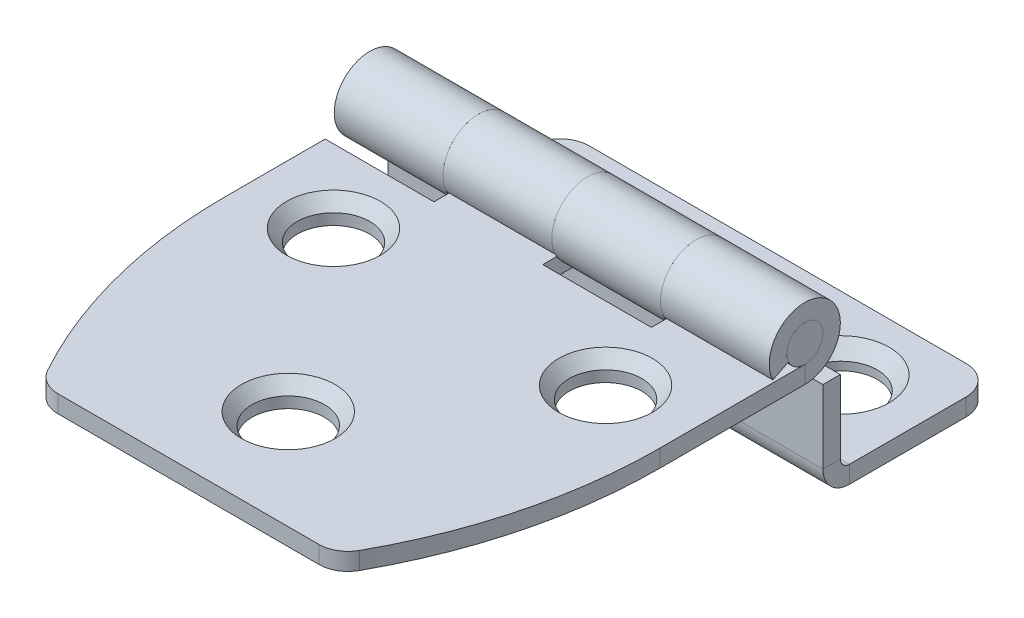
ISO-10303-21;
HEADER;
FILE_DESCRIPTION(('STEP AP214'),'2;1');
FILE_NAME('part.step','',(''),(''),'','','');
FILE_SCHEMA(('AUTOMOTIVE_DESIGN { 1 0 10303 214 1 1 1 1 }'));
ENDSEC;
DATA;
#1=APPLICATION_CONTEXT('core data for automotive mechanical design processes');
#2=APPLICATION_PROTOCOL_DEFINITION('international standard','automotive_design',2000,#1);
#3=PRODUCT_CONTEXT('',#1,'mechanical');
#4=PRODUCT('Part','Part','',(#3));
#5=PRODUCT_RELATED_PRODUCT_CATEGORY('part','',(#4));
#6=PRODUCT_DEFINITION_FORMATION('','',#4);
#7=PRODUCT_DEFINITION_CONTEXT('part definition',#1,'design');
#8=PRODUCT_DEFINITION('design','',#6,#7);
#9=PRODUCT_DEFINITION_SHAPE('','',#8);
#10=(LENGTH_UNIT() NAMED_UNIT(*) SI_UNIT(.MILLI.,.METRE.));
#11=(NAMED_UNIT(*) PLANE_ANGLE_UNIT() SI_UNIT($,.RADIAN.));
#12=(NAMED_UNIT(*) SI_UNIT($,.STERADIAN.) SOLID_ANGLE_UNIT());
#13=UNCERTAINTY_MEASURE_WITH_UNIT(LENGTH_MEASURE(1.E-05),#10,'distance_accuracy_value','');
#14=(GEOMETRIC_REPRESENTATION_CONTEXT(3) GLOBAL_UNCERTAINTY_ASSIGNED_CONTEXT((#13)) GLOBAL_UNIT_ASSIGNED_CONTEXT((#10,
#11,#12)) REPRESENTATION_CONTEXT('',''));
#15=CARTESIAN_POINT('',(0.,0.,0.));
#16=DIRECTION('',(0.,0.,1.));
#17=DIRECTION('',(1.,0.,0.));
#18=AXIS2_PLACEMENT_3D('',#15,#16,#17);
#19=CARTESIAN_POINT('',(38.1,0.,0.));
#20=DIRECTION('',(-1.,0.,0.));
#21=DIRECTION('',(0.,0.,1.));
#22=AXIS2_PLACEMENT_3D('',#19,#20,#21);
#23=CYLINDRICAL_SURFACE('',#22,1.5875);
#24=CARTESIAN_POINT('',(38.1,0.,0.));
#25=DIRECTION('',(1.,0.,0.));
#26=DIRECTION('',(0.,0.,-1.));
#27=AXIS2_PLACEMENT_3D('',#24,#25,#26);
#28=CIRCLE('',#27,1.5875);
#29=CARTESIAN_POINT('',(38.1,0.,1.5875));
#30=VERTEX_POINT('',#29);
#31=EDGE_CURVE('P0_E9',#30,#30,#28,.T.);
#32=CARTESIAN_POINT('',(0.,0.,0.));
#33=DIRECTION('',(1.,0.,0.));
#34=DIRECTION('',(0.,0.,-1.));
#35=AXIS2_PLACEMENT_3D('',#32,#33,#34);
#36=CIRCLE('',#35,1.5875);
#37=CARTESIAN_POINT('',(0.,0.,1.5875));
#38=VERTEX_POINT('',#37);
#39=EDGE_CURVE('P0_E17',#38,#38,#36,.T.);
#40=CARTESIAN_POINT('',(38.1,0.,1.5875));
#41=CARTESIAN_POINT('',(37.703125,0.,1.5875));
#42=CARTESIAN_POINT('',(37.30625,0.,1.5875));
#43=CARTESIAN_POINT('',(36.5125,0.,1.5875));
#44=CARTESIAN_POINT('',(36.115625,0.,1.5875));
#45=CARTESIAN_POINT('',(35.321875,0.,1.5875));
#46=CARTESIAN_POINT('',(34.925,0.,1.5875));
#47=CARTESIAN_POINT('',(34.13125,0.,1.5875));
#48=CARTESIAN_POINT('',(33.734375,0.,1.5875));
#49=CARTESIAN_POINT('',(32.940625,0.,1.5875));
#50=CARTESIAN_POINT('',(32.54375,0.,1.5875));
#51=CARTESIAN_POINT('',(31.75,0.,1.5875));
#52=CARTESIAN_POINT('',(31.353125,0.,1.5875));
#53=CARTESIAN_POINT('',(30.559375,0.,1.5875));
#54=CARTESIAN_POINT('',(30.1625,0.,1.5875));
#55=CARTESIAN_POINT('',(29.36875,0.,1.5875));
#56=CARTESIAN_POINT('',(28.971875,0.,1.5875));
#57=CARTESIAN_POINT('',(28.178125,0.,1.5875));
#58=CARTESIAN_POINT('',(27.78125,0.,1.5875));
#59=CARTESIAN_POINT('',(26.9875,0.,1.5875));
#60=CARTESIAN_POINT('',(26.590625,0.,1.5875));
#61=CARTESIAN_POINT('',(25.796875,0.,1.5875));
#62=CARTESIAN_POINT('',(25.4,0.,1.5875));
#63=CARTESIAN_POINT('',(24.60625,0.,1.5875));
#64=CARTESIAN_POINT('',(24.209375,0.,1.5875));
#65=CARTESIAN_POINT('',(23.415625,0.,1.5875));
#66=CARTESIAN_POINT('',(23.01875,0.,1.5875));
#67=CARTESIAN_POINT('',(22.225,0.,1.5875));
#68=CARTESIAN_POINT('',(21.828125,0.,1.5875));
#69=CARTESIAN_POINT('',(21.034375,0.,1.5875));
#70=CARTESIAN_POINT('',(20.6375,0.,1.5875));
#71=CARTESIAN_POINT('',(19.84375,0.,1.5875));
#72=CARTESIAN_POINT('',(19.446875,0.,1.5875));
#73=CARTESIAN_POINT('',(18.653125,0.,1.5875));
#74=CARTESIAN_POINT('',(18.25625,0.,1.5875));
#75=CARTESIAN_POINT('',(17.4625,0.,1.5875));
#76=CARTESIAN_POINT('',(17.065625,0.,1.5875));
#77=CARTESIAN_POINT('',(16.271875,0.,1.5875));
#78=CARTESIAN_POINT('',(15.875,0.,1.5875));
#79=CARTESIAN_POINT('',(15.08125,0.,1.5875));
#80=CARTESIAN_POINT('',(14.684375,0.,1.5875));
#81=CARTESIAN_POINT('',(13.890625,0.,1.5875));
#82=CARTESIAN_POINT('',(13.49375,0.,1.5875));
#83=CARTESIAN_POINT('',(12.7,0.,1.5875));
#84=CARTESIAN_POINT('',(12.303125,0.,1.5875));
#85=CARTESIAN_POINT('',(11.509375,0.,1.5875));
#86=CARTESIAN_POINT('',(11.1125,0.,1.5875));
#87=CARTESIAN_POINT('',(10.31875,0.,1.5875));
#88=CARTESIAN_POINT('',(9.92187499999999,0.,1.5875));
#89=CARTESIAN_POINT('',(9.128125,0.,1.5875));
#90=CARTESIAN_POINT('',(8.73124999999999,0.,1.5875));
#91=CARTESIAN_POINT('',(7.93749999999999,0.,1.5875));
#92=CARTESIAN_POINT('',(7.54062499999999,0.,1.5875));
#93=CARTESIAN_POINT('',(6.746875,0.,1.5875));
#94=CARTESIAN_POINT('',(6.35,0.,1.5875));
#95=CARTESIAN_POINT('',(5.55625,0.,1.5875));
#96=CARTESIAN_POINT('',(5.159375,0.,1.5875));
#97=CARTESIAN_POINT('',(4.365625,0.,1.5875));
#98=CARTESIAN_POINT('',(3.96875,0.,1.5875));
#99=CARTESIAN_POINT('',(3.175,0.,1.5875));
#100=CARTESIAN_POINT('',(2.778125,0.,1.5875));
#101=CARTESIAN_POINT('',(1.984375,0.,1.5875));
#102=CARTESIAN_POINT('',(1.5875,0.,1.5875));
#103=CARTESIAN_POINT('',(0.79375,0.,1.5875));
#104=CARTESIAN_POINT('',(0.396875,0.,1.5875));
#105=CARTESIAN_POINT('',(0.,0.,1.5875));
#106=B_SPLINE_CURVE_WITH_KNOTS('',3,(#40,#41,#42,#43,#44,#45,#46,#47,#48,#49,#50,#51,#52,#53,
#54,#55,#56,#57,#58,#59,#60,#61,#62,#63,#64,#65,#66,#67,#68,#69,#70,#71,#72,#73,#74,#75,#76,#77,
#78,#79,#80,#81,#82,#83,#84,#85,#86,#87,#88,#89,#90,#91,#92,#93,#94,#95,#96,#97,#98,#99,#100,
#101,#102,#103,#104,#105),.UNSPECIFIED.,.F.,.F.,(4,2,2,2,2,2,2,2,2,2,2,2,2,2,2,2,2,2,2,2,2,2,2,
2,2,2,2,2,2,2,2,2,4),(0.,1.190625,2.38125,3.571875,4.7625,5.953125,7.14375,8.334375,
9.52500000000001,10.715625,11.90625,13.096875,14.2875,15.478125,16.66875,17.859375,19.05,
20.240625,21.43125,22.621875,23.8125,25.003125,26.19375,27.384375,28.575,29.765625,30.95625,
32.146875,33.3375,34.528125,35.71875,36.909375,38.1),.UNSPECIFIED.);
#107=EDGE_CURVE('P0_BSEAM14',#30,#38,#106,.T.);
#108=ORIENTED_EDGE('',*,*,#31,.F.);
#109=ORIENTED_EDGE('',*,*,#39,.T.);
#110=ORIENTED_EDGE('',*,*,#107,.T.);
#111=ORIENTED_EDGE('',*,*,#107,.F.);
#112=EDGE_LOOP('',(#108,#110,#109,#111));
#113=FACE_BOUND('',#112,.T.);
#114=ADVANCED_FACE('P0_F14',(#113),#23,.T.);
#115=CARTESIAN_POINT('',(38.1,0.,0.));
#116=DIRECTION('',(1.,0.,0.));
#117=DIRECTION('',(0.,0.,-1.));
#118=AXIS2_PLACEMENT_3D('',#115,#116,#117);
#119=PLANE('',#118);
#120=ORIENTED_EDGE('',*,*,#31,.T.);
#121=EDGE_LOOP('',(#120));
#122=FACE_BOUND('',#121,.T.);
#123=ADVANCED_FACE('P0_F29',(#122),#119,.T.);
#124=CARTESIAN_POINT('',(0.,0.,0.));
#125=DIRECTION('',(1.,0.,0.));
#126=DIRECTION('',(0.,0.,-1.));
#127=AXIS2_PLACEMENT_3D('',#124,#125,#126);
#128=PLANE('',#127);
#129=ORIENTED_EDGE('',*,*,#39,.F.);
#130=EDGE_LOOP('',(#129));
#131=FACE_BOUND('',#130,.T.);
#132=ADVANCED_FACE('P0_F27',(#131),#128,.F.);
#133=CLOSED_SHELL('',(#114,#123,#132));
#134=MANIFOLD_SOLID_BREP('P0_B1',#133);
#135=CARTESIAN_POINT('',(43.2196875,-3.1115,12.7));
#136=DIRECTION('',(0.,1.,0.));
#137=DIRECTION('',(0.,0.,1.));
#138=AXIS2_PLACEMENT_3D('',#135,#136,#137);
#139=PLANE('',#138);
#140=CARTESIAN_POINT('',(30.9626,-3.1115,10.3124));
#141=DIRECTION('',(0.,1.,0.));
#142=DIRECTION('',(0.,0.,1.));
#143=AXIS2_PLACEMENT_3D('',#140,#141,#142);
#144=CIRCLE('',#143,3.937);
#145=CARTESIAN_POINT('',(30.9626,-3.1115,14.2494));
#146=VERTEX_POINT('',#145);
#147=EDGE_CURVE('P1_E160',#146,#146,#144,.F.);
#148=ORIENTED_EDGE('',*,*,#147,.F.);
#149=EDGE_LOOP('',(#148));
#150=FACE_BOUND('',#149,.T.);
#151=DIRECTION('',(0.,0.,1.));
#152=VECTOR('',#151,1.);
#153=CARTESIAN_POINT('',(0.,-3.1115,0.));
#154=LINE('',#153,#152);
#155=CARTESIAN_POINT('',(0.,-3.1115,3.90525));
#156=VERTEX_POINT('',#155);
#157=CARTESIAN_POINT('',(0.,-3.1115,12.7));
#158=VERTEX_POINT('',#157);
#159=EDGE_CURVE('P1_E118',#156,#158,#154,.T.);
#160=ORIENTED_EDGE('',*,*,#159,.F.);
#161=DIRECTION('',(-1.,0.,0.));
#162=VECTOR('',#161,1.);
#163=CARTESIAN_POINT('',(0.,-3.1115,3.90525));
#164=LINE('',#163,#162);
#165=CARTESIAN_POINT('',(9.525,-3.1115,3.90525));
#166=VERTEX_POINT('',#165);
#167=EDGE_CURVE('P1_E348',#166,#156,#164,.T.);
#168=ORIENTED_EDGE('',*,*,#167,.F.);
#169=DIRECTION('',(0.,0.,1.));
#170=VECTOR('',#169,1.);
#171=CARTESIAN_POINT('',(9.525,-3.1115,-3.1115));
#172=LINE('',#171,#170);
#173=CARTESIAN_POINT('',(9.525,-3.1115,0.));
#174=VERTEX_POINT('',#173);
#175=EDGE_CURVE('P1_E352',#174,#166,#172,.T.);
#176=ORIENTED_EDGE('',*,*,#175,.F.);
#177=DIRECTION('',(-1.,0.,0.));
#178=VECTOR('',#177,1.);
#179=CARTESIAN_POINT('',(0.,-3.1115,0.));
#180=LINE('',#179,#178);
#181=CARTESIAN_POINT('',(19.05,-3.1115,0.));
#182=VERTEX_POINT('',#181);
#183=EDGE_CURVE('P1_E132',#182,#174,#180,.T.);
#184=ORIENTED_EDGE('',*,*,#183,.F.);
#185=DIRECTION('',(0.,0.,-1.));
#186=VECTOR('',#185,1.);
#187=CARTESIAN_POINT('',(19.05,-3.1115,-3.1115));
#188=LINE('',#187,#186);
#189=CARTESIAN_POINT('',(19.05,-3.1115,3.90525));
#190=VERTEX_POINT('',#189);
#191=EDGE_CURVE('P1_E332',#190,#182,#188,.T.);
#192=ORIENTED_EDGE('',*,*,#191,.F.);
#193=DIRECTION('',(-1.,0.,0.));
#194=VECTOR('',#193,1.);
#195=CARTESIAN_POINT('',(19.05,-3.1115,3.90525));
#196=LINE('',#195,#194);
#197=CARTESIAN_POINT('',(28.575,-3.1115,3.90525));
#198=VERTEX_POINT('',#197);
#199=EDGE_CURVE('P1_E324',#198,#190,#196,.T.);
#200=ORIENTED_EDGE('',*,*,#199,.F.);
#201=DIRECTION('',(0.,0.,1.));
#202=VECTOR('',#201,1.);
#203=CARTESIAN_POINT('',(28.575,-3.1115,-3.1115));
#204=LINE('',#203,#202);
#205=CARTESIAN_POINT('',(28.575,-3.1115,0.));
#206=VERTEX_POINT('',#205);
#207=EDGE_CURVE('P1_E329',#206,#198,#204,.T.);
#208=ORIENTED_EDGE('',*,*,#207,.F.);
#209=CARTESIAN_POINT('',(38.1,-3.1115,0.));
#210=VERTEX_POINT('',#209);
#211=EDGE_CURVE('P1_E133',#210,#206,#180,.T.);
#212=ORIENTED_EDGE('',*,*,#211,.F.);
#213=DIRECTION('',(0.,0.,-1.));
#214=VECTOR('',#213,1.);
#215=CARTESIAN_POINT('',(38.1,-3.1115,0.));
#216=LINE('',#215,#214);
#217=CARTESIAN_POINT('',(38.1,-3.1115,12.7));
#218=VERTEX_POINT('',#217);
#219=EDGE_CURVE('P1_E129',#218,#210,#216,.T.);
#220=ORIENTED_EDGE('',*,*,#219,.F.);
#221=CARTESIAN_POINT('',(-5.11968750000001,-3.1115,12.7));
#222=DIRECTION('',(0.,1.,0.));
#223=DIRECTION('',(0.,0.,-1.));
#224=AXIS2_PLACEMENT_3D('',#221,#222,#223);
#225=CIRCLE('',#224,43.2196875);
#226=CARTESIAN_POINT('',(32.7028097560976,-3.1115,33.6141121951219));
#227=VERTEX_POINT('',#226);
#228=EDGE_CURVE('P1_E69',#227,#218,#225,.T.);
#229=ORIENTED_EDGE('',*,*,#228,.F.);
#230=CARTESIAN_POINT('',(30.48,-3.1115,32.385));
#231=DIRECTION('',(0.,1.,0.));
#232=DIRECTION('',(0.,0.,-1.));
#233=AXIS2_PLACEMENT_3D('',#230,#231,#232);
#234=CIRCLE('',#233,2.54);
#235=CARTESIAN_POINT('',(30.48,-3.1115,34.925));
#236=VERTEX_POINT('',#235);
#237=EDGE_CURVE('P1_E105',#236,#227,#234,.T.);
#238=ORIENTED_EDGE('',*,*,#237,.F.);
#239=DIRECTION('',(1.,0.,0.));
#240=VECTOR('',#239,1.);
#241=CARTESIAN_POINT('',(7.62,-3.1115,34.925));
#242=LINE('',#241,#240);
#243=CARTESIAN_POINT('',(7.62,-3.1115,34.925));
#244=VERTEX_POINT('',#243);
#245=EDGE_CURVE('P1_E125',#244,#236,#242,.T.);
#246=ORIENTED_EDGE('',*,*,#245,.F.);
#247=CARTESIAN_POINT('',(7.62,-3.1115,32.385));
#248=DIRECTION('',(0.,1.,0.));
#249=DIRECTION('',(0.,0.,1.));
#250=AXIS2_PLACEMENT_3D('',#247,#248,#249);
#251=CIRCLE('',#250,2.54);
#252=CARTESIAN_POINT('',(5.39719024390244,-3.1115,33.6141121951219));
#253=VERTEX_POINT('',#252);
#254=EDGE_CURVE('P1_E123',#253,#244,#251,.T.);
#255=ORIENTED_EDGE('',*,*,#254,.F.);
#256=CARTESIAN_POINT('',(43.2196875,-3.1115,12.7));
#257=DIRECTION('',(0.,1.,0.));
#258=DIRECTION('',(0.,0.,1.));
#259=AXIS2_PLACEMENT_3D('',#256,#257,#258);
#260=CIRCLE('',#259,43.2196875);
#261=EDGE_CURVE('P1_E120',#158,#253,#260,.T.);
#262=ORIENTED_EDGE('',*,*,#261,.F.);
#263=EDGE_LOOP('',(#160,#168,#176,#184,#192,#200,#208,#212,#220,#229,#238,#246,#255,#262));
#264=FACE_BOUND('',#263,.T.);
#265=CARTESIAN_POINT('',(19.05,-3.1115,26.1874));
#266=DIRECTION('',(0.,1.,0.));
#267=DIRECTION('',(0.,0.,1.));
#268=AXIS2_PLACEMENT_3D('',#265,#266,#267);
#269=CIRCLE('',#268,3.937);
#270=CARTESIAN_POINT('',(19.05,-3.1115,30.1244));
#271=VERTEX_POINT('',#270);
#272=EDGE_CURVE('P1_E157',#271,#271,#269,.F.);
#273=ORIENTED_EDGE('',*,*,#272,.F.);
#274=EDGE_LOOP('',(#273));
#275=FACE_BOUND('',#274,.T.);
#276=CARTESIAN_POINT('',(7.13740000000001,-3.1115,10.3124));
#277=DIRECTION('',(0.,1.,0.));
#278=DIRECTION('',(0.,0.,1.));
#279=AXIS2_PLACEMENT_3D('',#276,#277,#278);
#280=CIRCLE('',#279,3.937);
#281=CARTESIAN_POINT('',(7.13740000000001,-3.1115,14.2494));
#282=VERTEX_POINT('',#281);
#283=EDGE_CURVE('P1_E163',#282,#282,#280,.F.);
#284=ORIENTED_EDGE('',*,*,#283,.F.);
#285=EDGE_LOOP('',(#284));
#286=FACE_BOUND('',#285,.T.);
#287=ADVANCED_FACE('P1_F17',(#150,#264,#275,#286),#139,.F.);
#288=CARTESIAN_POINT('',(19.05,-0.695914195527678,1.42683554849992));
#289=DIRECTION('',(0.,0.898794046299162,0.438371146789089));
#290=DIRECTION('',(-1.,0.,0.));
#291=AXIS2_PLACEMENT_3D('',#288,#289,#290);
#292=PLANE('',#291);
#293=DIRECTION('',(0.,0.438371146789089,-0.898794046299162));
#294=VECTOR('',#293,1.);
#295=CARTESIAN_POINT('',(9.525,-0.695914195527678,1.42683554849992));
#296=LINE('',#295,#294);
#297=CARTESIAN_POINT('',(9.525,-0.695914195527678,1.42683554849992));
#298=VERTEX_POINT('',#297);
#299=CARTESIAN_POINT('',(9.525,-1.36399182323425,2.79659767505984));
#300=VERTEX_POINT('',#299);
#301=EDGE_CURVE('P1_E342',#298,#300,#296,.F.);
#302=ORIENTED_EDGE('',*,*,#301,.F.);
#303=DIRECTION('',(-1.,0.,0.));
#304=VECTOR('',#303,1.);
#305=CARTESIAN_POINT('',(0.,-0.695914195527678,1.42683554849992));
#306=LINE('',#305,#304);
#307=CARTESIAN_POINT('',(19.05,-0.695914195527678,1.42683554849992));
#308=VERTEX_POINT('',#307);
#309=EDGE_CURVE('P1_E286',#308,#298,#306,.T.);
#310=ORIENTED_EDGE('',*,*,#309,.F.);
#311=DIRECTION('',(0.,-0.438371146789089,0.898794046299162));
#312=VECTOR('',#311,1.);
#313=CARTESIAN_POINT('',(19.05,-0.695914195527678,1.42683554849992));
#314=LINE('',#313,#312);
#315=CARTESIAN_POINT('',(19.05,-1.36399182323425,2.79659767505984));
#316=VERTEX_POINT('',#315);
#317=EDGE_CURVE('P1_E310',#316,#308,#314,.F.);
#318=ORIENTED_EDGE('',*,*,#317,.F.);
#319=DIRECTION('',(-1.,0.,0.));
#320=VECTOR('',#319,1.);
#321=CARTESIAN_POINT('',(0.,-1.36399182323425,2.79659767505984));
#322=LINE('',#321,#320);
#323=EDGE_CURVE('P1_E278',#316,#300,#322,.T.);
#324=ORIENTED_EDGE('',*,*,#323,.T.);
#325=EDGE_LOOP('',(#302,#310,#318,#324));
#326=FACE_BOUND('',#325,.T.);
#327=ADVANCED_FACE('P1_F188',(#326),#292,.F.);
#328=CARTESIAN_POINT('',(0.,0.,0.));
#329=DIRECTION('',(-1.,0.,0.));
#330=DIRECTION('',(0.,-0.438371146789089,0.898794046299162));
#331=AXIS2_PLACEMENT_3D('',#328,#329,#330);
#332=CYLINDRICAL_SURFACE('',#331,3.1115);
#333=CARTESIAN_POINT('',(28.575,0.,0.));
#334=DIRECTION('',(1.,0.,0.));
#335=DIRECTION('',(0.,0.,-1.));
#336=AXIS2_PLACEMENT_3D('',#333,#334,#335);
#337=CIRCLE('',#336,3.1115);
#338=CARTESIAN_POINT('',(28.575,-1.36399182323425,2.79659767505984));
#339=VERTEX_POINT('',#338);
#340=EDGE_CURVE('P1_E314',#339,#206,#337,.F.);
#341=ORIENTED_EDGE('',*,*,#340,.F.);
#342=CARTESIAN_POINT('',(38.1,-1.36399182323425,2.79659767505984));
#343=VERTEX_POINT('',#342);
#344=EDGE_CURVE('P1_E275',#343,#339,#322,.T.);
#345=ORIENTED_EDGE('',*,*,#344,.F.);
#346=CARTESIAN_POINT('',(38.1,0.,0.));
#347=DIRECTION('',(-1.,0.,0.));
#348=DIRECTION('',(0.,0.,1.));
#349=AXIS2_PLACEMENT_3D('',#346,#347,#348);
#350=CIRCLE('',#349,3.1115);
#351=EDGE_CURVE('P1_E267',#210,#343,#350,.F.);
#352=ORIENTED_EDGE('',*,*,#351,.F.);
#353=ORIENTED_EDGE('',*,*,#211,.T.);
#354=EDGE_LOOP('',(#341,#345,#352,#353));
#355=FACE_BOUND('',#354,.T.);
#356=ADVANCED_FACE('P1_F194',(#355),#332,.T.);
#357=CARTESIAN_POINT('',(0.,0.,0.));
#358=DIRECTION('',(-1.,0.,0.));
#359=DIRECTION('',(0.,-0.438371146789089,0.898794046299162));
#360=AXIS2_PLACEMENT_3D('',#357,#358,#359);
#361=CYLINDRICAL_SURFACE('',#360,1.5875);
#362=ORIENTED_EDGE('',*,*,#309,.T.);
#363=CARTESIAN_POINT('',(9.525,0.,0.));
#364=DIRECTION('',(1.,0.,0.));
#365=DIRECTION('',(0.,0.,-1.));
#366=AXIS2_PLACEMENT_3D('',#363,#364,#365);
#367=CIRCLE('',#366,1.5875);
#368=CARTESIAN_POINT('',(9.525,-1.5875,0.));
#369=VERTEX_POINT('',#368);
#370=EDGE_CURVE('P1_E340',#298,#369,#367,.F.);
#371=ORIENTED_EDGE('',*,*,#370,.T.);
#372=DIRECTION('',(-1.,0.,0.));
#373=VECTOR('',#372,1.);
#374=CARTESIAN_POINT('',(0.,-1.5875,0.));
#375=LINE('',#374,#373);
#376=CARTESIAN_POINT('',(19.05,-1.5875,0.));
#377=VERTEX_POINT('',#376);
#378=EDGE_CURVE('P1_E111',#377,#369,#375,.T.);
#379=ORIENTED_EDGE('',*,*,#378,.F.);
#380=CARTESIAN_POINT('',(19.05,0.,0.));
#381=DIRECTION('',(-1.,0.,0.));
#382=DIRECTION('',(0.,0.,1.));
#383=AXIS2_PLACEMENT_3D('',#380,#381,#382);
#384=CIRCLE('',#383,1.5875);
#385=EDGE_CURVE('P1_E151',#377,#308,#384,.F.);
#386=ORIENTED_EDGE('',*,*,#385,.T.);
#387=EDGE_LOOP('',(#362,#371,#379,#386));
#388=FACE_BOUND('',#387,.T.);
#389=ADVANCED_FACE('P1_F224',(#388),#361,.F.);
#390=CARTESIAN_POINT('',(0.,-1.5875,0.));
#391=DIRECTION('',(1.,0.,0.));
#392=DIRECTION('',(0.,0.,-1.));
#393=AXIS2_PLACEMENT_3D('',#390,#391,#392);
#394=PLANE('',#393);
#395=DIRECTION('',(0.,0.,1.));
#396=VECTOR('',#395,1.);
#397=CARTESIAN_POINT('',(0.,-1.5875,0.));
#398=LINE('',#397,#396);
#399=CARTESIAN_POINT('',(0.,-1.5875,3.90525));
#400=VERTEX_POINT('',#399);
#401=CARTESIAN_POINT('',(0.,-1.5875,12.7));
#402=VERTEX_POINT('',#401);
#403=EDGE_CURVE('P1_E77',#400,#402,#398,.T.);
#404=ORIENTED_EDGE('',*,*,#403,.F.);
#405=DIRECTION('',(0.,-1.,0.));
#406=VECTOR('',#405,1.);
#407=CARTESIAN_POINT('',(0.,3.1115,3.90525));
#408=LINE('',#407,#406);
#409=EDGE_CURVE('P1_E237',#400,#156,#408,.T.);
#410=ORIENTED_EDGE('',*,*,#409,.T.);
#411=ORIENTED_EDGE('',*,*,#159,.T.);
#412=DIRECTION('',(0.,-1.,0.));
#413=VECTOR('',#412,1.);
#414=CARTESIAN_POINT('',(0.,-1.5875,12.7));
#415=LINE('',#414,#413);
#416=EDGE_CURVE('P1_E146',#402,#158,#415,.T.);
#417=ORIENTED_EDGE('',*,*,#416,.F.);
#418=EDGE_LOOP('',(#404,#410,#411,#417));
#419=FACE_BOUND('',#418,.T.);
#420=ADVANCED_FACE('P1_F221',(#419),#394,.F.);
#421=CARTESIAN_POINT('',(43.2196875,-1.5875,12.7));
#422=DIRECTION('',(0.,-1.,0.));
#423=DIRECTION('',(0.,0.,-1.));
#424=AXIS2_PLACEMENT_3D('',#421,#422,#423);
#425=CYLINDRICAL_SURFACE('',#424,43.2196875);
#426=ORIENTED_EDGE('',*,*,#261,.T.);
#427=DIRECTION('',(0.,-1.,0.));
#428=VECTOR('',#427,1.);
#429=CARTESIAN_POINT('',(5.39719024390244,-1.5875,33.6141121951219));
#430=LINE('',#429,#428);
#431=CARTESIAN_POINT('',(5.39719024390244,-1.5875,33.6141121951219));
#432=VERTEX_POINT('',#431);
#433=EDGE_CURVE('P1_E143',#432,#253,#430,.T.);
#434=ORIENTED_EDGE('',*,*,#433,.F.);
#435=CARTESIAN_POINT('',(43.2196875,-1.5875,12.7));
#436=DIRECTION('',(0.,1.,0.));
#437=DIRECTION('',(0.,0.,1.));
#438=AXIS2_PLACEMENT_3D('',#435,#436,#437);
#439=CIRCLE('',#438,43.2196875);
#440=EDGE_CURVE('P1_E242',#402,#432,#439,.T.);
#441=ORIENTED_EDGE('',*,*,#440,.F.);
#442=ORIENTED_EDGE('',*,*,#416,.T.);
#443=EDGE_LOOP('',(#426,#434,#441,#442));
#444=FACE_BOUND('',#443,.T.);
#445=ADVANCED_FACE('P1_F217',(#444),#425,.T.);
#446=CARTESIAN_POINT('',(7.62,-1.5875,32.385));
#447=DIRECTION('',(0.,-1.,0.));
#448=DIRECTION('',(0.,0.,-1.));
#449=AXIS2_PLACEMENT_3D('',#446,#447,#448);
#450=CYLINDRICAL_SURFACE('',#449,2.54);
#451=ORIENTED_EDGE('',*,*,#254,.T.);
#452=DIRECTION('',(0.,-1.,0.));
#453=VECTOR('',#452,1.);
#454=CARTESIAN_POINT('',(7.62,-1.5875,34.925));
#455=LINE('',#454,#453);
#456=CARTESIAN_POINT('',(7.62,-1.5875,34.925));
#457=VERTEX_POINT('',#456);
#458=EDGE_CURVE('P1_E140',#457,#244,#455,.T.);
#459=ORIENTED_EDGE('',*,*,#458,.F.);
#460=CARTESIAN_POINT('',(7.62,-1.5875,32.385));
#461=DIRECTION('',(0.,1.,0.));
#462=DIRECTION('',(0.,0.,1.));
#463=AXIS2_PLACEMENT_3D('',#460,#461,#462);
#464=CIRCLE('',#463,2.54);
#465=EDGE_CURVE('P1_E244',#432,#457,#464,.T.);
#466=ORIENTED_EDGE('',*,*,#465,.F.);
#467=ORIENTED_EDGE('',*,*,#433,.T.);
#468=EDGE_LOOP('',(#451,#459,#466,#467));
#469=FACE_BOUND('',#468,.T.);
#470=ADVANCED_FACE('P1_F213',(#469),#450,.T.);
#471=CARTESIAN_POINT('',(7.62,-1.5875,34.925));
#472=DIRECTION('',(0.,0.,-1.));
#473=DIRECTION('',(-1.,0.,0.));
#474=AXIS2_PLACEMENT_3D('',#471,#472,#473);
#475=PLANE('',#474);
#476=ORIENTED_EDGE('',*,*,#245,.T.);
#477=DIRECTION('',(0.,-1.,0.));
#478=VECTOR('',#477,1.);
#479=CARTESIAN_POINT('',(30.48,-1.5875,34.925));
#480=LINE('',#479,#478);
#481=CARTESIAN_POINT('',(30.48,-1.5875,34.925));
#482=VERTEX_POINT('',#481);
#483=EDGE_CURVE('P1_E106',#482,#236,#480,.T.);
#484=ORIENTED_EDGE('',*,*,#483,.F.);
#485=DIRECTION('',(1.,0.,0.));
#486=VECTOR('',#485,1.);
#487=CARTESIAN_POINT('',(7.62,-1.5875,34.925));
#488=LINE('',#487,#486);
#489=EDGE_CURVE('P1_E97',#457,#482,#488,.T.);
#490=ORIENTED_EDGE('',*,*,#489,.F.);
#491=ORIENTED_EDGE('',*,*,#458,.T.);
#492=EDGE_LOOP('',(#476,#484,#490,#491));
#493=FACE_BOUND('',#492,.T.);
#494=ADVANCED_FACE('P1_F210',(#493),#475,.F.);
#495=CARTESIAN_POINT('',(30.48,-1.5875,32.385));
#496=DIRECTION('',(0.,-1.,0.));
#497=DIRECTION('',(0.,0.,-1.));
#498=AXIS2_PLACEMENT_3D('',#495,#496,#497);
#499=CYLINDRICAL_SURFACE('',#498,2.54);
#500=ORIENTED_EDGE('',*,*,#237,.T.);
#501=DIRECTION('',(0.,-1.,0.));
#502=VECTOR('',#501,1.);
#503=CARTESIAN_POINT('',(32.7028097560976,-1.5875,33.6141121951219));
#504=LINE('',#503,#502);
#505=CARTESIAN_POINT('',(32.7028097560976,-1.5875,33.6141121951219));
#506=VERTEX_POINT('',#505);
#507=EDGE_CURVE('P1_E102',#506,#227,#504,.T.);
#508=ORIENTED_EDGE('',*,*,#507,.F.);
#509=CARTESIAN_POINT('',(30.48,-1.5875,32.385));
#510=DIRECTION('',(0.,1.,0.));
#511=DIRECTION('',(0.,0.,-1.));
#512=AXIS2_PLACEMENT_3D('',#509,#510,#511);
#513=CIRCLE('',#512,2.54);
#514=EDGE_CURVE('P1_E91',#482,#506,#513,.T.);
#515=ORIENTED_EDGE('',*,*,#514,.F.);
#516=ORIENTED_EDGE('',*,*,#483,.T.);
#517=EDGE_LOOP('',(#500,#508,#515,#516));
#518=FACE_BOUND('',#517,.T.);
#519=ADVANCED_FACE('P1_F103',(#518),#499,.T.);
#520=CARTESIAN_POINT('',(-5.11968750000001,-1.5875,12.7));
#521=DIRECTION('',(0.,-1.,0.));
#522=DIRECTION('',(0.,0.,-1.));
#523=AXIS2_PLACEMENT_3D('',#520,#521,#522);
#524=CYLINDRICAL_SURFACE('',#523,43.2196875);
#525=ORIENTED_EDGE('',*,*,#228,.T.);
#526=DIRECTION('',(0.,-1.,0.));
#527=VECTOR('',#526,1.);
#528=CARTESIAN_POINT('',(38.1,-1.5875,12.7));
#529=LINE('',#528,#527);
#530=CARTESIAN_POINT('',(38.1,-1.5875,12.7));
#531=VERTEX_POINT('',#530);
#532=EDGE_CURVE('P1_E107',#531,#218,#529,.T.);
#533=ORIENTED_EDGE('',*,*,#532,.F.);
#534=CARTESIAN_POINT('',(-5.11968750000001,-1.5875,12.7));
#535=DIRECTION('',(0.,1.,0.));
#536=DIRECTION('',(0.,0.,-1.));
#537=AXIS2_PLACEMENT_3D('',#534,#535,#536);
#538=CIRCLE('',#537,43.2196875);
#539=EDGE_CURVE('P1_E95',#506,#531,#538,.T.);
#540=ORIENTED_EDGE('',*,*,#539,.F.);
#541=ORIENTED_EDGE('',*,*,#507,.T.);
#542=EDGE_LOOP('',(#525,#533,#540,#541));
#543=FACE_BOUND('',#542,.T.);
#544=ADVANCED_FACE('P1_F109',(#543),#524,.T.);
#545=CARTESIAN_POINT('',(38.1,-1.5875,0.));
#546=DIRECTION('',(-1.,0.,0.));
#547=DIRECTION('',(0.,0.,1.));
#548=AXIS2_PLACEMENT_3D('',#545,#546,#547);
#549=PLANE('',#548);
#550=ORIENTED_EDGE('',*,*,#219,.T.);
#551=DIRECTION('',(0.,-1.,0.));
#552=VECTOR('',#551,1.);
#553=CARTESIAN_POINT('',(38.1,-1.5875,0.));
#554=LINE('',#553,#552);
#555=CARTESIAN_POINT('',(38.1,-1.5875,0.));
#556=VERTEX_POINT('',#555);
#557=EDGE_CURVE('P1_E117',#556,#210,#554,.T.);
#558=ORIENTED_EDGE('',*,*,#557,.F.);
#559=DIRECTION('',(0.,0.,-1.));
#560=VECTOR('',#559,1.);
#561=CARTESIAN_POINT('',(38.1,-1.5875,0.));
#562=LINE('',#561,#560);
#563=EDGE_CURVE('P1_E41',#531,#556,#562,.T.);
#564=ORIENTED_EDGE('',*,*,#563,.F.);
#565=ORIENTED_EDGE('',*,*,#532,.T.);
#566=EDGE_LOOP('',(#550,#558,#564,#565));
#567=FACE_BOUND('',#566,.T.);
#568=ADVANCED_FACE('P1_F202',(#567),#549,.F.);
#569=CARTESIAN_POINT('',(43.2196875,-1.5875,12.7));
#570=DIRECTION('',(0.,1.,0.));
#571=DIRECTION('',(0.,0.,1.));
#572=AXIS2_PLACEMENT_3D('',#569,#570,#571);
#573=PLANE('',#572);
#574=CARTESIAN_POINT('',(7.13740000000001,-1.5875,10.3124));
#575=DIRECTION('',(0.,1.,0.));
#576=DIRECTION('',(0.,0.,1.));
#577=AXIS2_PLACEMENT_3D('',#574,#575,#576);
#578=CIRCLE('',#577,4.1021);
#579=CARTESIAN_POINT('',(7.13740000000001,-1.5875,14.4145));
#580=VERTEX_POINT('',#579);
#581=EDGE_CURVE('P1_E370',#580,#580,#578,.T.);
#582=ORIENTED_EDGE('',*,*,#581,.F.);
#583=EDGE_LOOP('',(#582));
#584=FACE_BOUND('',#583,.T.);
#585=CARTESIAN_POINT('',(30.9626,-1.5875,10.3124));
#586=DIRECTION('',(0.,1.,0.));
#587=DIRECTION('',(0.,0.,1.));
#588=AXIS2_PLACEMENT_3D('',#585,#586,#587);
#589=CIRCLE('',#588,4.1021);
#590=CARTESIAN_POINT('',(30.9626,-1.5875,14.4145));
#591=VERTEX_POINT('',#590);
#592=EDGE_CURVE('P1_E364',#591,#591,#589,.T.);
#593=ORIENTED_EDGE('',*,*,#592,.F.);
#594=EDGE_LOOP('',(#593));
#595=FACE_BOUND('',#594,.T.);
#596=CARTESIAN_POINT('',(19.05,-1.5875,26.1874));
#597=DIRECTION('',(0.,1.,0.));
#598=DIRECTION('',(0.,0.,1.));
#599=AXIS2_PLACEMENT_3D('',#596,#597,#598);
#600=CIRCLE('',#599,4.1021);
#601=CARTESIAN_POINT('',(19.05,-1.5875,30.2895));
#602=VERTEX_POINT('',#601);
#603=EDGE_CURVE('P1_E358',#602,#602,#600,.T.);
#604=ORIENTED_EDGE('',*,*,#603,.F.);
#605=EDGE_LOOP('',(#604));
#606=FACE_BOUND('',#605,.T.);
#607=DIRECTION('',(1.,0.,0.));
#608=VECTOR('',#607,1.);
#609=CARTESIAN_POINT('',(43.2196875,-1.5875,3.90525000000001));
#610=LINE('',#609,#608);
#611=CARTESIAN_POINT('',(9.525,-1.5875,3.90525));
#612=VERTEX_POINT('',#611);
#613=EDGE_CURVE('P1_E334',#400,#612,#610,.T.);
#614=ORIENTED_EDGE('',*,*,#613,.F.);
#615=ORIENTED_EDGE('',*,*,#403,.T.);
#616=ORIENTED_EDGE('',*,*,#440,.T.);
#617=ORIENTED_EDGE('',*,*,#465,.T.);
#618=ORIENTED_EDGE('',*,*,#489,.T.);
#619=ORIENTED_EDGE('',*,*,#514,.T.);
#620=ORIENTED_EDGE('',*,*,#539,.T.);
#621=ORIENTED_EDGE('',*,*,#563,.T.);
#622=CARTESIAN_POINT('',(28.575,-1.5875,0.));
#623=VERTEX_POINT('',#622);
#624=EDGE_CURVE('P1_E115',#556,#623,#375,.T.);
#625=ORIENTED_EDGE('',*,*,#624,.T.);
#626=DIRECTION('',(0.,0.,-1.));
#627=VECTOR('',#626,1.);
#628=CARTESIAN_POINT('',(28.575,-1.5875,12.7));
#629=LINE('',#628,#627);
#630=CARTESIAN_POINT('',(28.575,-1.5875,3.90525));
#631=VERTEX_POINT('',#630);
#632=EDGE_CURVE('P1_E32',#631,#623,#629,.T.);
#633=ORIENTED_EDGE('',*,*,#632,.F.);
#634=DIRECTION('',(1.,0.,0.));
#635=VECTOR('',#634,1.);
#636=CARTESIAN_POINT('',(43.2196875,-1.5875,3.90525));
#637=LINE('',#636,#635);
#638=CARTESIAN_POINT('',(19.05,-1.5875,3.90525));
#639=VERTEX_POINT('',#638);
#640=EDGE_CURVE('P1_E281',#639,#631,#637,.T.);
#641=ORIENTED_EDGE('',*,*,#640,.F.);
#642=DIRECTION('',(0.,0.,1.));
#643=VECTOR('',#642,1.);
#644=CARTESIAN_POINT('',(19.05,-1.5875,12.7));
#645=LINE('',#644,#643);
#646=EDGE_CURVE('P1_E302',#377,#639,#645,.T.);
#647=ORIENTED_EDGE('',*,*,#646,.F.);
#648=ORIENTED_EDGE('',*,*,#378,.T.);
#649=DIRECTION('',(0.,0.,-1.));
#650=VECTOR('',#649,1.);
#651=CARTESIAN_POINT('',(9.525,-1.5875,12.7));
#652=LINE('',#651,#650);
#653=EDGE_CURVE('P1_E337',#612,#369,#652,.T.);
#654=ORIENTED_EDGE('',*,*,#653,.F.);
#655=EDGE_LOOP('',(#614,#615,#616,#617,#618,#619,#620,#621,#625,#633,#641,#647,#648,#654));
#656=FACE_BOUND('',#655,.T.);
#657=ADVANCED_FACE('P1_F93',(#584,#595,#606,#656),#573,.T.);
#658=DIRECTION('',(0.,0.438371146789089,-0.898794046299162));
#659=VECTOR('',#658,1.);
#660=CARTESIAN_POINT('',(28.575,-0.695914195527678,1.42683554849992));
#661=LINE('',#660,#659);
#662=CARTESIAN_POINT('',(28.575,-0.695914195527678,1.42683554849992));
#663=VERTEX_POINT('',#662);
#664=EDGE_CURVE('P1_E318',#663,#339,#661,.F.);
#665=ORIENTED_EDGE('',*,*,#664,.F.);
#666=CARTESIAN_POINT('',(38.1,-0.695914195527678,1.42683554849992));
#667=VERTEX_POINT('',#666);
#668=EDGE_CURVE('P1_E284',#667,#663,#306,.T.);
#669=ORIENTED_EDGE('',*,*,#668,.F.);
#670=DIRECTION('',(0.,-0.438371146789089,0.898794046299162));
#671=VECTOR('',#670,1.);
#672=CARTESIAN_POINT('',(38.1,-0.695914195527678,1.42683554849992));
#673=LINE('',#672,#671);
#674=EDGE_CURVE('P1_E121',#667,#343,#673,.T.);
#675=ORIENTED_EDGE('',*,*,#674,.T.);
#676=ORIENTED_EDGE('',*,*,#344,.T.);
#677=EDGE_LOOP('',(#665,#669,#675,#676));
#678=FACE_BOUND('',#677,.T.);
#679=ADVANCED_FACE('P1_F197',(#678),#292,.F.);
#680=CARTESIAN_POINT('',(38.1,0.,0.));
#681=DIRECTION('',(1.,0.,0.));
#682=DIRECTION('',(0.,0.,-1.));
#683=AXIS2_PLACEMENT_3D('',#680,#681,#682);
#684=PLANE('',#683);
#685=ORIENTED_EDGE('',*,*,#674,.F.);
#686=CARTESIAN_POINT('',(38.1,0.,0.));
#687=DIRECTION('',(-1.,0.,0.));
#688=DIRECTION('',(0.,0.,1.));
#689=AXIS2_PLACEMENT_3D('',#686,#687,#688);
#690=CIRCLE('',#689,1.5875);
#691=EDGE_CURVE('P1_E269',#556,#667,#690,.F.);
#692=ORIENTED_EDGE('',*,*,#691,.F.);
#693=ORIENTED_EDGE('',*,*,#557,.T.);
#694=ORIENTED_EDGE('',*,*,#351,.T.);
#695=EDGE_LOOP('',(#685,#692,#693,#694));
#696=FACE_BOUND('',#695,.T.);
#697=ADVANCED_FACE('P1_F266',(#696),#684,.T.);
#698=CARTESIAN_POINT('',(9.525,0.,0.));
#699=DIRECTION('',(1.,0.,0.));
#700=DIRECTION('',(0.,0.,-1.));
#701=AXIS2_PLACEMENT_3D('',#698,#699,#700);
#702=CIRCLE('',#701,3.1115);
#703=EDGE_CURVE('P1_E154',#300,#174,#702,.F.);
#704=ORIENTED_EDGE('',*,*,#703,.F.);
#705=ORIENTED_EDGE('',*,*,#323,.F.);
#706=CARTESIAN_POINT('',(19.05,0.,0.));
#707=DIRECTION('',(-1.,0.,0.));
#708=DIRECTION('',(0.,0.,1.));
#709=AXIS2_PLACEMENT_3D('',#706,#707,#708);
#710=CIRCLE('',#709,3.1115);
#711=EDGE_CURVE('P1_E295',#182,#316,#710,.F.);
#712=ORIENTED_EDGE('',*,*,#711,.F.);
#713=ORIENTED_EDGE('',*,*,#183,.T.);
#714=EDGE_LOOP('',(#704,#705,#712,#713));
#715=FACE_BOUND('',#714,.T.);
#716=ADVANCED_FACE('P1_F437',(#715),#332,.T.);
#717=ORIENTED_EDGE('',*,*,#668,.T.);
#718=CARTESIAN_POINT('',(28.575,0.,0.));
#719=DIRECTION('',(1.,0.,0.));
#720=DIRECTION('',(0.,0.,-1.));
#721=AXIS2_PLACEMENT_3D('',#718,#719,#720);
#722=CIRCLE('',#721,1.5875);
#723=EDGE_CURVE('P1_E149',#663,#623,#722,.F.);
#724=ORIENTED_EDGE('',*,*,#723,.T.);
#725=ORIENTED_EDGE('',*,*,#624,.F.);
#726=ORIENTED_EDGE('',*,*,#691,.T.);
#727=EDGE_LOOP('',(#717,#724,#725,#726));
#728=FACE_BOUND('',#727,.T.);
#729=ADVANCED_FACE('P1_F231',(#728),#361,.F.);
#730=CARTESIAN_POINT('',(19.05,3.1115,-3.1115));
#731=DIRECTION('',(-1.,0.,0.));
#732=DIRECTION('',(0.,0.,1.));
#733=AXIS2_PLACEMENT_3D('',#730,#731,#732);
#734=PLANE('',#733);
#735=ORIENTED_EDGE('',*,*,#711,.T.);
#736=ORIENTED_EDGE('',*,*,#317,.T.);
#737=ORIENTED_EDGE('',*,*,#385,.F.);
#738=ORIENTED_EDGE('',*,*,#646,.T.);
#739=DIRECTION('',(0.,-1.,0.));
#740=VECTOR('',#739,1.);
#741=CARTESIAN_POINT('',(19.05,3.1115,3.90525));
#742=LINE('',#741,#740);
#743=EDGE_CURVE('P1_E321',#639,#190,#742,.T.);
#744=ORIENTED_EDGE('',*,*,#743,.T.);
#745=ORIENTED_EDGE('',*,*,#191,.T.);
#746=EDGE_LOOP('',(#735,#736,#737,#738,#744,#745));
#747=FACE_BOUND('',#746,.T.);
#748=ADVANCED_FACE('P1_F432',(#747),#734,.F.);
#749=CARTESIAN_POINT('',(19.05,3.1115,3.90525));
#750=DIRECTION('',(0.,0.,1.));
#751=DIRECTION('',(1.,0.,0.));
#752=AXIS2_PLACEMENT_3D('',#749,#750,#751);
#753=PLANE('',#752);
#754=ORIENTED_EDGE('',*,*,#640,.T.);
#755=DIRECTION('',(0.,-1.,0.));
#756=VECTOR('',#755,1.);
#757=CARTESIAN_POINT('',(28.575,3.1115,3.90525));
#758=LINE('',#757,#756);
#759=EDGE_CURVE('P1_E322',#631,#198,#758,.T.);
#760=ORIENTED_EDGE('',*,*,#759,.T.);
#761=ORIENTED_EDGE('',*,*,#199,.T.);
#762=ORIENTED_EDGE('',*,*,#743,.F.);
#763=EDGE_LOOP('',(#754,#760,#761,#762));
#764=FACE_BOUND('',#763,.T.);
#765=ADVANCED_FACE('P1_F429',(#764),#753,.F.);
#766=CARTESIAN_POINT('',(28.575,3.1115,-3.1115));
#767=DIRECTION('',(1.,0.,0.));
#768=DIRECTION('',(0.,0.,-1.));
#769=AXIS2_PLACEMENT_3D('',#766,#767,#768);
#770=PLANE('',#769);
#771=ORIENTED_EDGE('',*,*,#340,.T.);
#772=ORIENTED_EDGE('',*,*,#207,.T.);
#773=ORIENTED_EDGE('',*,*,#759,.F.);
#774=ORIENTED_EDGE('',*,*,#632,.T.);
#775=ORIENTED_EDGE('',*,*,#723,.F.);
#776=ORIENTED_EDGE('',*,*,#664,.T.);
#777=EDGE_LOOP('',(#771,#772,#773,#774,#775,#776));
#778=FACE_BOUND('',#777,.T.);
#779=ADVANCED_FACE('P1_F424',(#778),#770,.F.);
#780=CARTESIAN_POINT('',(0.,3.1115,3.90525));
#781=DIRECTION('',(0.,0.,1.));
#782=DIRECTION('',(1.,0.,0.));
#783=AXIS2_PLACEMENT_3D('',#780,#781,#782);
#784=PLANE('',#783);
#785=ORIENTED_EDGE('',*,*,#613,.T.);
#786=DIRECTION('',(0.,-1.,0.));
#787=VECTOR('',#786,1.);
#788=CARTESIAN_POINT('',(9.525,3.1115,3.90525));
#789=LINE('',#788,#787);
#790=EDGE_CURVE('P1_E345',#612,#166,#789,.T.);
#791=ORIENTED_EDGE('',*,*,#790,.T.);
#792=ORIENTED_EDGE('',*,*,#167,.T.);
#793=ORIENTED_EDGE('',*,*,#409,.F.);
#794=EDGE_LOOP('',(#785,#791,#792,#793));
#795=FACE_BOUND('',#794,.T.);
#796=ADVANCED_FACE('P1_F421',(#795),#784,.F.);
#797=CARTESIAN_POINT('',(9.525,3.1115,-3.1115));
#798=DIRECTION('',(1.,0.,0.));
#799=DIRECTION('',(0.,0.,-1.));
#800=AXIS2_PLACEMENT_3D('',#797,#798,#799);
#801=PLANE('',#800);
#802=ORIENTED_EDGE('',*,*,#653,.T.);
#803=ORIENTED_EDGE('',*,*,#370,.F.);
#804=ORIENTED_EDGE('',*,*,#301,.T.);
#805=ORIENTED_EDGE('',*,*,#703,.T.);
#806=ORIENTED_EDGE('',*,*,#175,.T.);
#807=ORIENTED_EDGE('',*,*,#790,.F.);
#808=EDGE_LOOP('',(#802,#803,#804,#805,#806,#807));
#809=FACE_BOUND('',#808,.T.);
#810=ADVANCED_FACE('P1_F419',(#809),#801,.F.);
#811=CARTESIAN_POINT('',(19.05,-1.5875,26.1874));
#812=DIRECTION('',(0.,1.,0.));
#813=DIRECTION('',(0.,0.,1.));
#814=AXIS2_PLACEMENT_3D('',#811,#812,#813);
#815=CYLINDRICAL_SURFACE('',#814,3.175);
#816=CARTESIAN_POINT('',(19.05,-2.6540065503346,26.1874));
#817=DIRECTION('',(0.,1.,0.));
#818=DIRECTION('',(0.,0.,1.));
#819=AXIS2_PLACEMENT_3D('',#816,#817,#818);
#820=CIRCLE('',#819,3.175);
#821=CARTESIAN_POINT('',(19.05,-2.6540065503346,29.3624));
#822=VERTEX_POINT('',#821);
#823=EDGE_CURVE('P1_E355',#822,#822,#820,.T.);
#824=ORIENTED_EDGE('',*,*,#823,.T.);
#825=EDGE_LOOP('',(#824));
#826=FACE_BOUND('',#825,.T.);
#827=CARTESIAN_POINT('',(19.05,-3.6195,26.1874));
#828=DIRECTION('',(0.,-1.,0.));
#829=DIRECTION('',(0.,0.,-1.));
#830=AXIS2_PLACEMENT_3D('',#827,#828,#829);
#831=CIRCLE('',#830,3.175);
#832=CARTESIAN_POINT('',(19.05,-3.6195,23.0124));
#833=VERTEX_POINT('',#832);
#834=EDGE_CURVE('P1_E373',#833,#833,#831,.T.);
#835=ORIENTED_EDGE('',*,*,#834,.T.);
#836=EDGE_LOOP('',(#835));
#837=FACE_BOUND('',#836,.T.);
#838=ADVANCED_FACE('P1_F415',(#826,#837),#815,.F.);
#839=CARTESIAN_POINT('',(19.05,-1.5875,26.1874));
#840=DIRECTION('',(0.,1.,0.));
#841=DIRECTION('',(0.,0.,1.));
#842=AXIS2_PLACEMENT_3D('',#839,#840,#841);
#843=CONICAL_SURFACE('',#842,4.1021,0.715584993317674);
#844=ORIENTED_EDGE('',*,*,#823,.F.);
#845=EDGE_LOOP('',(#844));
#846=FACE_BOUND('',#845,.T.);
#847=ORIENTED_EDGE('',*,*,#603,.T.);
#848=EDGE_LOOP('',(#847));
#849=FACE_BOUND('',#848,.T.);
#850=ADVANCED_FACE('P1_F411',(#846,#849),#843,.F.);
#851=CARTESIAN_POINT('',(30.9626,-1.5875,10.3124));
#852=DIRECTION('',(0.,1.,0.));
#853=DIRECTION('',(0.,0.,1.));
#854=AXIS2_PLACEMENT_3D('',#851,#852,#853);
#855=CYLINDRICAL_SURFACE('',#854,3.175);
#856=CARTESIAN_POINT('',(30.9626,-2.6540065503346,10.3124));
#857=DIRECTION('',(0.,1.,0.));
#858=DIRECTION('',(0.,0.,1.));
#859=AXIS2_PLACEMENT_3D('',#856,#857,#858);
#860=CIRCLE('',#859,3.175);
#861=CARTESIAN_POINT('',(30.9626,-2.6540065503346,13.4874));
#862=VERTEX_POINT('',#861);
#863=EDGE_CURVE('P1_E361',#862,#862,#860,.T.);
#864=ORIENTED_EDGE('',*,*,#863,.T.);
#865=EDGE_LOOP('',(#864));
#866=FACE_BOUND('',#865,.T.);
#867=CARTESIAN_POINT('',(30.9626,-3.6195,10.3124));
#868=DIRECTION('',(0.,-1.,0.));
#869=DIRECTION('',(0.,0.,-1.));
#870=AXIS2_PLACEMENT_3D('',#867,#868,#869);
#871=CIRCLE('',#870,3.175);
#872=CARTESIAN_POINT('',(30.9626,-3.6195,7.1374));
#873=VERTEX_POINT('',#872);
#874=EDGE_CURVE('P1_E376',#873,#873,#871,.T.);
#875=ORIENTED_EDGE('',*,*,#874,.T.);
#876=EDGE_LOOP('',(#875));
#877=FACE_BOUND('',#876,.T.);
#878=ADVANCED_FACE('P1_F407',(#866,#877),#855,.F.);
#879=CARTESIAN_POINT('',(30.9626,-1.5875,10.3124));
#880=DIRECTION('',(0.,1.,0.));
#881=DIRECTION('',(0.,0.,1.));
#882=AXIS2_PLACEMENT_3D('',#879,#880,#881);
#883=CONICAL_SURFACE('',#882,4.1021,0.715584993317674);
#884=ORIENTED_EDGE('',*,*,#863,.F.);
#885=EDGE_LOOP('',(#884));
#886=FACE_BOUND('',#885,.T.);
#887=ORIENTED_EDGE('',*,*,#592,.T.);
#888=EDGE_LOOP('',(#887));
#889=FACE_BOUND('',#888,.T.);
#890=ADVANCED_FACE('P1_F403',(#886,#889),#883,.F.);
#891=CARTESIAN_POINT('',(7.13740000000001,-1.5875,10.3124));
#892=DIRECTION('',(0.,1.,0.));
#893=DIRECTION('',(0.,0.,1.));
#894=AXIS2_PLACEMENT_3D('',#891,#892,#893);
#895=CYLINDRICAL_SURFACE('',#894,3.175);
#896=CARTESIAN_POINT('',(7.13740000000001,-2.6540065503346,10.3124));
#897=DIRECTION('',(0.,1.,0.));
#898=DIRECTION('',(0.,0.,1.));
#899=AXIS2_PLACEMENT_3D('',#896,#897,#898);
#900=CIRCLE('',#899,3.175);
#901=CARTESIAN_POINT('',(7.13740000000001,-2.6540065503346,13.4874));
#902=VERTEX_POINT('',#901);
#903=EDGE_CURVE('P1_E367',#902,#902,#900,.T.);
#904=ORIENTED_EDGE('',*,*,#903,.T.);
#905=EDGE_LOOP('',(#904));
#906=FACE_BOUND('',#905,.T.);
#907=CARTESIAN_POINT('',(7.13740000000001,-3.6195,10.3124));
#908=DIRECTION('',(0.,-1.,0.));
#909=DIRECTION('',(0.,0.,-1.));
#910=AXIS2_PLACEMENT_3D('',#907,#908,#909);
#911=CIRCLE('',#910,3.175);
#912=CARTESIAN_POINT('',(7.13740000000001,-3.6195,7.1374));
#913=VERTEX_POINT('',#912);
#914=EDGE_CURVE('P1_E379',#913,#913,#911,.T.);
#915=ORIENTED_EDGE('',*,*,#914,.T.);
#916=EDGE_LOOP('',(#915));
#917=FACE_BOUND('',#916,.T.);
#918=ADVANCED_FACE('P1_F383',(#906,#917),#895,.F.);
#919=CARTESIAN_POINT('',(7.13740000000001,-1.5875,10.3124));
#920=DIRECTION('',(0.,1.,0.));
#921=DIRECTION('',(0.,0.,1.));
#922=AXIS2_PLACEMENT_3D('',#919,#920,#921);
#923=CONICAL_SURFACE('',#922,4.1021,0.715584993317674);
#924=ORIENTED_EDGE('',*,*,#903,.F.);
#925=EDGE_LOOP('',(#924));
#926=FACE_BOUND('',#925,.T.);
#927=ORIENTED_EDGE('',*,*,#581,.T.);
#928=EDGE_LOOP('',(#927));
#929=FACE_BOUND('',#928,.T.);
#930=ADVANCED_FACE('P1_F396',(#926,#929),#923,.F.);
#931=CARTESIAN_POINT('',(19.05,-3.6195,26.1874));
#932=DIRECTION('',(0.,-1.,0.));
#933=DIRECTION('',(0.,0.,-1.));
#934=AXIS2_PLACEMENT_3D('',#931,#932,#933);
#935=PLANE('',#934);
#936=CARTESIAN_POINT('',(19.05,-3.6195,26.1874));
#937=DIRECTION('',(0.,-1.,0.));
#938=DIRECTION('',(0.,0.,-1.));
#939=AXIS2_PLACEMENT_3D('',#936,#937,#938);
#940=CIRCLE('',#939,3.429);
#941=CARTESIAN_POINT('',(19.05,-3.6195,22.7584));
#942=VERTEX_POINT('',#941);
#943=EDGE_CURVE('P1_E166',#942,#942,#940,.T.);
#944=ORIENTED_EDGE('',*,*,#943,.T.);
#945=EDGE_LOOP('',(#944));
#946=FACE_BOUND('',#945,.T.);
#947=ORIENTED_EDGE('',*,*,#834,.F.);
#948=EDGE_LOOP('',(#947));
#949=FACE_BOUND('',#948,.T.);
#950=ADVANCED_FACE('P1_F391',(#946,#949),#935,.T.);
#951=CARTESIAN_POINT('',(30.9626,-3.6195,10.3124));
#952=DIRECTION('',(0.,-1.,0.));
#953=DIRECTION('',(0.,0.,-1.));
#954=AXIS2_PLACEMENT_3D('',#951,#952,#953);
#955=PLANE('',#954);
#956=CARTESIAN_POINT('',(30.9626,-3.6195,10.3124));
#957=DIRECTION('',(0.,-1.,0.));
#958=DIRECTION('',(0.,0.,-1.));
#959=AXIS2_PLACEMENT_3D('',#956,#957,#958);
#960=CIRCLE('',#959,3.429);
#961=CARTESIAN_POINT('',(30.9626,-3.6195,6.8834));
#962=VERTEX_POINT('',#961);
#963=EDGE_CURVE('P1_E25',#962,#962,#960,.T.);
#964=ORIENTED_EDGE('',*,*,#963,.T.);
#965=EDGE_LOOP('',(#964));
#966=FACE_BOUND('',#965,.T.);
#967=ORIENTED_EDGE('',*,*,#874,.F.);
#968=EDGE_LOOP('',(#967));
#969=FACE_BOUND('',#968,.T.);
#970=ADVANCED_FACE('P1_F171',(#966,#969),#955,.T.);
#971=CARTESIAN_POINT('',(7.13740000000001,-3.6195,10.3124));
#972=DIRECTION('',(0.,-1.,0.));
#973=DIRECTION('',(0.,0.,-1.));
#974=AXIS2_PLACEMENT_3D('',#971,#972,#973);
#975=PLANE('',#974);
#976=CARTESIAN_POINT('',(7.13740000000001,-3.6195,10.3124));
#977=DIRECTION('',(0.,-1.,0.));
#978=DIRECTION('',(0.,0.,-1.));
#979=AXIS2_PLACEMENT_3D('',#976,#977,#978);
#980=CIRCLE('',#979,3.429);
#981=CARTESIAN_POINT('',(7.13740000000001,-3.6195,6.8834));
#982=VERTEX_POINT('',#981);
#983=EDGE_CURVE('P1_E11',#982,#982,#980,.T.);
#984=ORIENTED_EDGE('',*,*,#983,.T.);
#985=EDGE_LOOP('',(#984));
#986=FACE_BOUND('',#985,.T.);
#987=ORIENTED_EDGE('',*,*,#914,.F.);
#988=EDGE_LOOP('',(#987));
#989=FACE_BOUND('',#988,.T.);
#990=ADVANCED_FACE('P1_F184',(#986,#989),#975,.T.);
#991=CARTESIAN_POINT('',(19.05,-3.1115,26.1874));
#992=DIRECTION('',(0.,-1.,0.));
#993=DIRECTION('',(0.,0.,-1.));
#994=AXIS2_PLACEMENT_3D('',#991,#992,#993);
#995=TOROIDAL_SURFACE('',#994,3.429,0.508);
#996=ORIENTED_EDGE('',*,*,#272,.T.);
#997=EDGE_LOOP('',(#996));
#998=FACE_BOUND('',#997,.T.);
#999=ORIENTED_EDGE('',*,*,#943,.F.);
#1000=EDGE_LOOP('',(#999));
#1001=FACE_BOUND('',#1000,.T.);
#1002=ADVANCED_FACE('P1_F176',(#998,#1001),#995,.T.);
#1003=CARTESIAN_POINT('',(30.9626,-3.1115,10.3124));
#1004=DIRECTION('',(0.,-1.,0.));
#1005=DIRECTION('',(0.,0.,-1.));
#1006=AXIS2_PLACEMENT_3D('',#1003,#1004,#1005);
#1007=TOROIDAL_SURFACE('',#1006,3.429,0.508);
#1008=ORIENTED_EDGE('',*,*,#147,.T.);
#1009=EDGE_LOOP('',(#1008));
#1010=FACE_BOUND('',#1009,.T.);
#1011=ORIENTED_EDGE('',*,*,#963,.F.);
#1012=EDGE_LOOP('',(#1011));
#1013=FACE_BOUND('',#1012,.T.);
#1014=ADVANCED_FACE('P1_F174',(#1010,#1013),#1007,.T.);
#1015=CARTESIAN_POINT('',(7.13740000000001,-3.1115,10.3124));
#1016=DIRECTION('',(0.,-1.,0.));
#1017=DIRECTION('',(0.,0.,-1.));
#1018=AXIS2_PLACEMENT_3D('',#1015,#1016,#1017);
#1019=TOROIDAL_SURFACE('',#1018,3.429,0.508);
#1020=ORIENTED_EDGE('',*,*,#283,.T.);
#1021=EDGE_LOOP('',(#1020));
#1022=FACE_BOUND('',#1021,.T.);
#1023=ORIENTED_EDGE('',*,*,#983,.F.);
#1024=EDGE_LOOP('',(#1023));
#1025=FACE_BOUND('',#1024,.T.);
#1026=ADVANCED_FACE('P1_F19',(#1022,#1025),#1019,.T.);
#1027=CLOSED_SHELL('',(#287,#327,#356,#389,#420,#445,#470,#494,#519,#544,#568,#657,#679,#697,
#716,#729,#748,#765,#779,#796,#810,#838,#850,#878,#890,#918,#930,#950,#970,#990,#1002,#1014,#1026));
#1028=MANIFOLD_SOLID_BREP('P1_B1',#1027);
#1029=CARTESIAN_POINT('',(38.1,-3.90524999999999,-0.793750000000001));
#1030=DIRECTION('',(-1.,0.,0.));
#1031=DIRECTION('',(0.,0.,1.));
#1032=AXIS2_PLACEMENT_3D('',#1029,#1030,#1031);
#1033=CYLINDRICAL_SURFACE('',#1032,2.31775);
#1034=DIRECTION('',(-1.,0.,0.));
#1035=VECTOR('',#1034,1.);
#1036=CARTESIAN_POINT('',(38.1,-1.5875,-0.793750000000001));
#1037=LINE('',#1036,#1035);
#1038=CARTESIAN_POINT('',(28.575,-1.5875,-0.793750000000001));
#1039=VERTEX_POINT('',#1038);
#1040=CARTESIAN_POINT('',(19.05,-1.5875,-0.793750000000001));
#1041=VERTEX_POINT('',#1040);
#1042=EDGE_CURVE('P2_E217',#1039,#1041,#1037,.T.);
#1043=ORIENTED_EDGE('',*,*,#1042,.F.);
#1044=CARTESIAN_POINT('',(28.575,-3.90524999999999,-0.793750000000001));
#1045=DIRECTION('',(-1.,0.,0.));
#1046=DIRECTION('',(0.,0.,1.));
#1047=AXIS2_PLACEMENT_3D('',#1044,#1045,#1046);
#1048=CIRCLE('',#1047,2.31775);
#1049=CARTESIAN_POINT('',(28.575,-3.90524999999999,-3.1115));
#1050=VERTEX_POINT('',#1049);
#1051=EDGE_CURVE('P2_E458',#1039,#1050,#1048,.T.);
#1052=ORIENTED_EDGE('',*,*,#1051,.T.);
#1053=DIRECTION('',(-1.,0.,0.));
#1054=VECTOR('',#1053,1.);
#1055=CARTESIAN_POINT('',(38.1,-3.90524999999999,-3.1115));
#1056=LINE('',#1055,#1054);
#1057=CARTESIAN_POINT('',(19.05,-3.90524999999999,-3.1115));
#1058=VERTEX_POINT('',#1057);
#1059=EDGE_CURVE('P2_E223',#1050,#1058,#1056,.T.);
#1060=ORIENTED_EDGE('',*,*,#1059,.T.);
#1061=CARTESIAN_POINT('',(19.05,-3.90524999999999,-0.793750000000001));
#1062=DIRECTION('',(1.,0.,0.));
#1063=DIRECTION('',(0.,0.,-1.));
#1064=AXIS2_PLACEMENT_3D('',#1061,#1062,#1063);
#1065=CIRCLE('',#1064,2.31775);
#1066=EDGE_CURVE('P2_E469',#1058,#1041,#1065,.T.);
#1067=ORIENTED_EDGE('',*,*,#1066,.T.);
#1068=EDGE_LOOP('',(#1043,#1052,#1060,#1067));
#1069=FACE_BOUND('',#1068,.T.);
#1070=ADVANCED_FACE('P2_F16',(#1069),#1033,.T.);
#1071=CARTESIAN_POINT('',(38.1,-1.5875,0.));
#1072=DIRECTION('',(0.,1.,0.));
#1073=DIRECTION('',(0.,0.,1.));
#1074=AXIS2_PLACEMENT_3D('',#1071,#1072,#1073);
#1075=PLANE('',#1074);
#1076=DIRECTION('',(-1.,0.,0.));
#1077=VECTOR('',#1076,1.);
#1078=CARTESIAN_POINT('',(38.1,-1.5875,0.));
#1079=LINE('',#1078,#1077);
#1080=CARTESIAN_POINT('',(28.575,-1.5875,0.));
#1081=VERTEX_POINT('',#1080);
#1082=CARTESIAN_POINT('',(19.05,-1.5875,0.));
#1083=VERTEX_POINT('',#1082);
#1084=EDGE_CURVE('P2_E211',#1081,#1083,#1079,.T.);
#1085=ORIENTED_EDGE('',*,*,#1084,.F.);
#1086=DIRECTION('',(0.,0.,-1.));
#1087=VECTOR('',#1086,1.);
#1088=CARTESIAN_POINT('',(28.575,-1.58749999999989,-16.6634));
#1089=LINE('',#1088,#1087);
#1090=EDGE_CURVE('P2_E188',#1081,#1039,#1089,.T.);
#1091=ORIENTED_EDGE('',*,*,#1090,.T.);
#1092=ORIENTED_EDGE('',*,*,#1042,.T.);
#1093=DIRECTION('',(0.,0.,1.));
#1094=VECTOR('',#1093,1.);
#1095=CARTESIAN_POINT('',(19.05,-1.58749999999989,-16.6634));
#1096=LINE('',#1095,#1094);
#1097=EDGE_CURVE('P2_E472',#1041,#1083,#1096,.T.);
#1098=ORIENTED_EDGE('',*,*,#1097,.T.);
#1099=EDGE_LOOP('',(#1085,#1091,#1092,#1098));
#1100=FACE_BOUND('',#1099,.T.);
#1101=ADVANCED_FACE('P2_F531',(#1100),#1075,.T.);
#1102=CARTESIAN_POINT('',(38.1,0.,0.));
#1103=DIRECTION('',(-1.,0.,0.));
#1104=DIRECTION('',(0.,0.,1.));
#1105=AXIS2_PLACEMENT_3D('',#1102,#1103,#1104);
#1106=CYLINDRICAL_SURFACE('',#1105,1.5875);
#1107=DIRECTION('',(-1.,0.,0.));
#1108=VECTOR('',#1107,1.);
#1109=CARTESIAN_POINT('',(38.1,-0.984328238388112,-1.24549354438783));
#1110=LINE('',#1109,#1108);
#1111=CARTESIAN_POINT('',(28.575,-0.984328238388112,-1.24549354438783));
#1112=VERTEX_POINT('',#1111);
#1113=CARTESIAN_POINT('',(19.05,-0.984328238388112,-1.24549354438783));
#1114=VERTEX_POINT('',#1113);
#1115=EDGE_CURVE('P2_E199',#1112,#1114,#1110,.T.);
#1116=ORIENTED_EDGE('',*,*,#1115,.F.);
#1117=CARTESIAN_POINT('',(28.575,0.,0.));
#1118=DIRECTION('',(1.,0.,0.));
#1119=DIRECTION('',(0.,0.,-1.));
#1120=AXIS2_PLACEMENT_3D('',#1117,#1118,#1119);
#1121=CIRCLE('',#1120,1.5875);
#1122=EDGE_CURVE('P2_E182',#1081,#1112,#1121,.F.);
#1123=ORIENTED_EDGE('',*,*,#1122,.F.);
#1124=ORIENTED_EDGE('',*,*,#1084,.T.);
#1125=CARTESIAN_POINT('',(19.05,0.,0.));
#1126=DIRECTION('',(-1.,0.,0.));
#1127=DIRECTION('',(0.,0.,1.));
#1128=AXIS2_PLACEMENT_3D('',#1125,#1126,#1127);
#1129=CIRCLE('',#1128,1.5875);
#1130=EDGE_CURVE('P2_E207',#1114,#1083,#1129,.F.);
#1131=ORIENTED_EDGE('',*,*,#1130,.F.);
#1132=EDGE_LOOP('',(#1116,#1123,#1124,#1131));
#1133=FACE_BOUND('',#1132,.T.);
#1134=ADVANCED_FACE('P2_F205',(#1133),#1106,.F.);
#1135=CARTESIAN_POINT('',(38.1,-1.9292833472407,-2.44116734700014));
#1136=DIRECTION('',(0.,-0.784562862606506,0.620049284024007));
#1137=DIRECTION('',(0.,-0.620049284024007,-0.784562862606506));
#1138=AXIS2_PLACEMENT_3D('',#1135,#1136,#1137);
#1139=PLANE('',#1138);
#1140=DIRECTION('',(-1.,0.,0.));
#1141=VECTOR('',#1140,1.);
#1142=CARTESIAN_POINT('',(38.1,-1.9292833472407,-2.44116734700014));
#1143=LINE('',#1142,#1141);
#1144=CARTESIAN_POINT('',(28.575,-1.9292833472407,-2.44116734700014));
#1145=VERTEX_POINT('',#1144);
#1146=CARTESIAN_POINT('',(19.05,-1.9292833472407,-2.44116734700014));
#1147=VERTEX_POINT('',#1146);
#1148=EDGE_CURVE('P2_E201',#1145,#1147,#1143,.T.);
#1149=ORIENTED_EDGE('',*,*,#1148,.F.);
#1150=DIRECTION('',(0.,0.620049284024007,0.784562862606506));
#1151=VECTOR('',#1150,1.);
#1152=CARTESIAN_POINT('',(28.575,-6.90995413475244,-8.74332659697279));
#1153=LINE('',#1152,#1151);
#1154=EDGE_CURVE('P2_E185',#1145,#1112,#1153,.T.);
#1155=ORIENTED_EDGE('',*,*,#1154,.T.);
#1156=ORIENTED_EDGE('',*,*,#1115,.T.);
#1157=DIRECTION('',(0.,-0.620049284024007,-0.784562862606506));
#1158=VECTOR('',#1157,1.);
#1159=CARTESIAN_POINT('',(19.05,-6.90995413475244,-8.74332659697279));
#1160=LINE('',#1159,#1158);
#1161=EDGE_CURVE('P2_E577',#1114,#1147,#1160,.T.);
#1162=ORIENTED_EDGE('',*,*,#1161,.T.);
#1163=EDGE_LOOP('',(#1149,#1155,#1156,#1162));
#1164=FACE_BOUND('',#1163,.T.);
#1165=ADVANCED_FACE('P2_F197',(#1164),#1139,.T.);
#1166=CARTESIAN_POINT('',(38.1,0.,0.));
#1167=DIRECTION('',(-1.,0.,0.));
#1168=DIRECTION('',(0.,0.,1.));
#1169=AXIS2_PLACEMENT_3D('',#1166,#1167,#1168);
#1170=CYLINDRICAL_SURFACE('',#1169,3.1115);
#1171=CARTESIAN_POINT('',(28.575,0.,0.));
#1172=DIRECTION('',(1.,0.,0.));
#1173=DIRECTION('',(0.,0.,-1.));
#1174=AXIS2_PLACEMENT_3D('',#1171,#1172,#1173);
#1175=CIRCLE('',#1174,3.1115);
#1176=CARTESIAN_POINT('',(28.575,-3.1115,0.));
#1177=VERTEX_POINT('',#1176);
#1178=EDGE_CURVE('P2_E193',#1177,#1145,#1175,.F.);
#1179=ORIENTED_EDGE('',*,*,#1178,.T.);
#1180=ORIENTED_EDGE('',*,*,#1148,.T.);
#1181=CARTESIAN_POINT('',(19.05,0.,0.));
#1182=DIRECTION('',(-1.,0.,0.));
#1183=DIRECTION('',(0.,0.,1.));
#1184=AXIS2_PLACEMENT_3D('',#1181,#1182,#1183);
#1185=CIRCLE('',#1184,3.1115);
#1186=CARTESIAN_POINT('',(19.05,-3.1115,0.));
#1187=VERTEX_POINT('',#1186);
#1188=EDGE_CURVE('P2_E488',#1147,#1187,#1185,.F.);
#1189=ORIENTED_EDGE('',*,*,#1188,.T.);
#1190=DIRECTION('',(-1.,0.,0.));
#1191=VECTOR('',#1190,1.);
#1192=CARTESIAN_POINT('',(38.1,-3.1115,0.));
#1193=LINE('',#1192,#1191);
#1194=EDGE_CURVE('P2_E382',#1177,#1187,#1193,.T.);
#1195=ORIENTED_EDGE('',*,*,#1194,.F.);
#1196=EDGE_LOOP('',(#1179,#1180,#1189,#1195));
#1197=FACE_BOUND('',#1196,.T.);
#1198=ADVANCED_FACE('P2_F555',(#1197),#1170,.T.);
#1199=CARTESIAN_POINT('',(38.1,-3.1115,0.));
#1200=DIRECTION('',(0.,1.,0.));
#1201=DIRECTION('',(0.,0.,1.));
#1202=AXIS2_PLACEMENT_3D('',#1199,#1200,#1201);
#1203=PLANE('',#1202);
#1204=DIRECTION('',(0.,0.,-1.));
#1205=VECTOR('',#1204,1.);
#1206=CARTESIAN_POINT('',(28.575,-3.11149999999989,-16.6634));
#1207=LINE('',#1206,#1205);
#1208=CARTESIAN_POINT('',(28.575,-3.1115,-0.793750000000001));
#1209=VERTEX_POINT('',#1208);
#1210=EDGE_CURVE('P2_E202',#1177,#1209,#1207,.T.);
#1211=ORIENTED_EDGE('',*,*,#1210,.F.);
#1212=ORIENTED_EDGE('',*,*,#1194,.T.);
#1213=DIRECTION('',(0.,0.,1.));
#1214=VECTOR('',#1213,1.);
#1215=CARTESIAN_POINT('',(19.05,-3.11149999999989,-16.6634));
#1216=LINE('',#1215,#1214);
#1217=CARTESIAN_POINT('',(19.05,-3.1115,-0.793750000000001));
#1218=VERTEX_POINT('',#1217);
#1219=EDGE_CURVE('P2_E579',#1218,#1187,#1216,.T.);
#1220=ORIENTED_EDGE('',*,*,#1219,.F.);
#1221=DIRECTION('',(-1.,0.,0.));
#1222=VECTOR('',#1221,1.);
#1223=CARTESIAN_POINT('',(38.1,-3.1115,-0.793750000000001));
#1224=LINE('',#1223,#1222);
#1225=EDGE_CURVE('P2_E380',#1209,#1218,#1224,.T.);
#1226=ORIENTED_EDGE('',*,*,#1225,.F.);
#1227=EDGE_LOOP('',(#1211,#1212,#1220,#1226));
#1228=FACE_BOUND('',#1227,.T.);
#1229=ADVANCED_FACE('P2_F549',(#1228),#1203,.F.);
#1230=CARTESIAN_POINT('',(38.1,-3.90524999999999,-0.793750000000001));
#1231=DIRECTION('',(-1.,0.,0.));
#1232=DIRECTION('',(0.,0.,1.));
#1233=AXIS2_PLACEMENT_3D('',#1230,#1231,#1232);
#1234=CYLINDRICAL_SURFACE('',#1233,0.793749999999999);
#1235=CARTESIAN_POINT('',(28.575,-3.90524999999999,-0.793750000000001));
#1236=DIRECTION('',(-1.,0.,0.));
#1237=DIRECTION('',(0.,0.,1.));
#1238=AXIS2_PLACEMENT_3D('',#1235,#1236,#1237);
#1239=CIRCLE('',#1238,0.793749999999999);
#1240=CARTESIAN_POINT('',(28.575,-3.90524999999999,-1.5875));
#1241=VERTEX_POINT('',#1240);
#1242=EDGE_CURVE('P2_E31',#1209,#1241,#1239,.T.);
#1243=ORIENTED_EDGE('',*,*,#1242,.F.);
#1244=ORIENTED_EDGE('',*,*,#1225,.T.);
#1245=CARTESIAN_POINT('',(19.05,-3.90524999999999,-0.793750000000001));
#1246=DIRECTION('',(1.,0.,0.));
#1247=DIRECTION('',(0.,0.,-1.));
#1248=AXIS2_PLACEMENT_3D('',#1245,#1246,#1247);
#1249=CIRCLE('',#1248,0.793749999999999);
#1250=CARTESIAN_POINT('',(19.05,-3.90524999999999,-1.5875));
#1251=VERTEX_POINT('',#1250);
#1252=EDGE_CURVE('P2_E465',#1251,#1218,#1249,.T.);
#1253=ORIENTED_EDGE('',*,*,#1252,.F.);
#1254=DIRECTION('',(-1.,0.,0.));
#1255=VECTOR('',#1254,1.);
#1256=CARTESIAN_POINT('',(38.1,-3.90524999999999,-1.5875));
#1257=LINE('',#1256,#1255);
#1258=EDGE_CURVE('P2_E379',#1241,#1251,#1257,.T.);
#1259=ORIENTED_EDGE('',*,*,#1258,.F.);
#1260=EDGE_LOOP('',(#1243,#1244,#1253,#1259));
#1261=FACE_BOUND('',#1260,.T.);
#1262=ADVANCED_FACE('P2_F462',(#1261),#1234,.F.);
#1263=CARTESIAN_POINT('',(9.52500000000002,-1.5875,-0.793750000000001));
#1264=VERTEX_POINT('',#1263);
#1265=CARTESIAN_POINT('',(0.,-1.5875,-0.793750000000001));
#1266=VERTEX_POINT('',#1265);
#1267=EDGE_CURVE('P2_E216',#1264,#1266,#1037,.T.);
#1268=ORIENTED_EDGE('',*,*,#1267,.F.);
#1269=CARTESIAN_POINT('',(9.52500000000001,-3.90524999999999,-0.793750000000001));
#1270=DIRECTION('',(-1.,0.,0.));
#1271=DIRECTION('',(0.,0.,1.));
#1272=AXIS2_PLACEMENT_3D('',#1269,#1270,#1271);
#1273=CIRCLE('',#1272,2.31775);
#1274=CARTESIAN_POINT('',(9.52500000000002,-3.90524999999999,-3.1115));
#1275=VERTEX_POINT('',#1274);
#1276=EDGE_CURVE('P2_E420',#1264,#1275,#1273,.T.);
#1277=ORIENTED_EDGE('',*,*,#1276,.T.);
#1278=CARTESIAN_POINT('',(0.,-3.90524999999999,-3.1115));
#1279=VERTEX_POINT('',#1278);
#1280=EDGE_CURVE('P2_E219',#1275,#1279,#1056,.T.);
#1281=ORIENTED_EDGE('',*,*,#1280,.T.);
#1282=CARTESIAN_POINT('',(0.,-3.90524999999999,-0.793750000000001));
#1283=DIRECTION('',(-1.,0.,0.));
#1284=DIRECTION('',(0.,0.,1.));
#1285=AXIS2_PLACEMENT_3D('',#1282,#1283,#1284);
#1286=CIRCLE('',#1285,2.31775);
#1287=EDGE_CURVE('P2_E347',#1266,#1279,#1286,.T.);
#1288=ORIENTED_EDGE('',*,*,#1287,.F.);
#1289=EDGE_LOOP('',(#1268,#1277,#1281,#1288));
#1290=FACE_BOUND('',#1289,.T.);
#1291=ADVANCED_FACE('P2_F417',(#1290),#1033,.T.);
#1292=CARTESIAN_POINT('',(9.52500000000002,-1.5875,0.));
#1293=VERTEX_POINT('',#1292);
#1294=CARTESIAN_POINT('',(0.,-1.5875,0.));
#1295=VERTEX_POINT('',#1294);
#1296=EDGE_CURVE('P2_E208',#1293,#1295,#1079,.T.);
#1297=ORIENTED_EDGE('',*,*,#1296,.F.);
#1298=DIRECTION('',(0.,0.,-1.));
#1299=VECTOR('',#1298,1.);
#1300=CARTESIAN_POINT('',(9.52500000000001,-1.58749999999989,-16.6634));
#1301=LINE('',#1300,#1299);
#1302=EDGE_CURVE('P2_E467',#1293,#1264,#1301,.T.);
#1303=ORIENTED_EDGE('',*,*,#1302,.T.);
#1304=ORIENTED_EDGE('',*,*,#1267,.T.);
#1305=DIRECTION('',(0.,0.,-1.));
#1306=VECTOR('',#1305,1.);
#1307=CARTESIAN_POINT('',(0.,-1.5875,0.));
#1308=LINE('',#1307,#1306);
#1309=EDGE_CURVE('P2_E350',#1295,#1266,#1308,.T.);
#1310=ORIENTED_EDGE('',*,*,#1309,.F.);
#1311=EDGE_LOOP('',(#1297,#1303,#1304,#1310));
#1312=FACE_BOUND('',#1311,.T.);
#1313=ADVANCED_FACE('P2_F539',(#1312),#1075,.T.);
#1314=CARTESIAN_POINT('',(9.52500000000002,-0.984328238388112,-1.24549354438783));
#1315=VERTEX_POINT('',#1314);
#1316=CARTESIAN_POINT('',(0.,-0.984328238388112,-1.24549354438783));
#1317=VERTEX_POINT('',#1316);
#1318=EDGE_CURVE('P2_E209',#1315,#1317,#1110,.T.);
#1319=ORIENTED_EDGE('',*,*,#1318,.F.);
#1320=CARTESIAN_POINT('',(9.52500000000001,0.,0.));
#1321=DIRECTION('',(1.,0.,0.));
#1322=DIRECTION('',(0.,0.,-1.));
#1323=AXIS2_PLACEMENT_3D('',#1320,#1321,#1322);
#1324=CIRCLE('',#1323,1.5875);
#1325=EDGE_CURVE('P2_E494',#1293,#1315,#1324,.F.);
#1326=ORIENTED_EDGE('',*,*,#1325,.F.);
#1327=ORIENTED_EDGE('',*,*,#1296,.T.);
#1328=CARTESIAN_POINT('',(0.,0.,0.));
#1329=DIRECTION('',(1.,0.,0.));
#1330=DIRECTION('',(0.,0.,-1.));
#1331=AXIS2_PLACEMENT_3D('',#1328,#1329,#1330);
#1332=CIRCLE('',#1331,1.5875);
#1333=EDGE_CURVE('P2_E353',#1317,#1295,#1332,.T.);
#1334=ORIENTED_EDGE('',*,*,#1333,.F.);
#1335=EDGE_LOOP('',(#1319,#1326,#1327,#1334));
#1336=FACE_BOUND('',#1335,.T.);
#1337=ADVANCED_FACE('P2_F547',(#1336),#1106,.F.);
#1338=CARTESIAN_POINT('',(9.52500000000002,-1.9292833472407,-2.44116734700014));
#1339=VERTEX_POINT('',#1338);
#1340=CARTESIAN_POINT('',(0.,-1.9292833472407,-2.44116734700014));
#1341=VERTEX_POINT('',#1340);
#1342=EDGE_CURVE('P2_E383',#1339,#1341,#1143,.T.);
#1343=ORIENTED_EDGE('',*,*,#1342,.F.);
#1344=DIRECTION('',(0.,0.620049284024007,0.784562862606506));
#1345=VECTOR('',#1344,1.);
#1346=CARTESIAN_POINT('',(9.52500000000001,-6.90995413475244,-8.74332659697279));
#1347=LINE('',#1346,#1345);
#1348=EDGE_CURVE('P2_E192',#1339,#1315,#1347,.T.);
#1349=ORIENTED_EDGE('',*,*,#1348,.T.);
#1350=ORIENTED_EDGE('',*,*,#1318,.T.);
#1351=DIRECTION('',(0.,0.620049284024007,0.784562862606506));
#1352=VECTOR('',#1351,1.);
#1353=CARTESIAN_POINT('',(0.,-1.9292833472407,-2.44116734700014));
#1354=LINE('',#1353,#1352);
#1355=EDGE_CURVE('P2_E356',#1341,#1317,#1354,.T.);
#1356=ORIENTED_EDGE('',*,*,#1355,.F.);
#1357=EDGE_LOOP('',(#1343,#1349,#1350,#1356));
#1358=FACE_BOUND('',#1357,.T.);
#1359=ADVANCED_FACE('P2_F576',(#1358),#1139,.T.);
#1360=CARTESIAN_POINT('',(9.52500000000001,0.,0.));
#1361=DIRECTION('',(1.,0.,0.));
#1362=DIRECTION('',(0.,0.,-1.));
#1363=AXIS2_PLACEMENT_3D('',#1360,#1361,#1362);
#1364=CIRCLE('',#1363,3.1115);
#1365=CARTESIAN_POINT('',(9.52500000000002,-3.1115,0.));
#1366=VERTEX_POINT('',#1365);
#1367=EDGE_CURVE('P2_E491',#1366,#1339,#1364,.F.);
#1368=ORIENTED_EDGE('',*,*,#1367,.T.);
#1369=ORIENTED_EDGE('',*,*,#1342,.T.);
#1370=CARTESIAN_POINT('',(0.,0.,0.));
#1371=DIRECTION('',(1.,0.,0.));
#1372=DIRECTION('',(0.,0.,-1.));
#1373=AXIS2_PLACEMENT_3D('',#1370,#1371,#1372);
#1374=CIRCLE('',#1373,3.1115);
#1375=CARTESIAN_POINT('',(0.,-3.1115,0.));
#1376=VERTEX_POINT('',#1375);
#1377=EDGE_CURVE('P2_E359',#1341,#1376,#1374,.T.);
#1378=ORIENTED_EDGE('',*,*,#1377,.T.);
#1379=EDGE_CURVE('P2_E381',#1366,#1376,#1193,.T.);
#1380=ORIENTED_EDGE('',*,*,#1379,.F.);
#1381=EDGE_LOOP('',(#1368,#1369,#1378,#1380));
#1382=FACE_BOUND('',#1381,.T.);
#1383=ADVANCED_FACE('P2_F407',(#1382),#1170,.T.);
#1384=DIRECTION('',(0.,0.,-1.));
#1385=VECTOR('',#1384,1.);
#1386=CARTESIAN_POINT('',(9.52500000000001,-3.11149999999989,-16.6634));
#1387=LINE('',#1386,#1385);
#1388=CARTESIAN_POINT('',(9.52500000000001,-3.1115,-0.793750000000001));
#1389=VERTEX_POINT('',#1388);
#1390=EDGE_CURVE('P2_E397',#1366,#1389,#1387,.T.);
#1391=ORIENTED_EDGE('',*,*,#1390,.F.);
#1392=ORIENTED_EDGE('',*,*,#1379,.T.);
#1393=DIRECTION('',(0.,0.,-1.));
#1394=VECTOR('',#1393,1.);
#1395=CARTESIAN_POINT('',(0.,-3.1115,0.));
#1396=LINE('',#1395,#1394);
#1397=CARTESIAN_POINT('',(0.,-3.1115,-0.793750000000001));
#1398=VERTEX_POINT('',#1397);
#1399=EDGE_CURVE('P2_E362',#1376,#1398,#1396,.T.);
#1400=ORIENTED_EDGE('',*,*,#1399,.T.);
#1401=EDGE_CURVE('P2_E378',#1389,#1398,#1224,.T.);
#1402=ORIENTED_EDGE('',*,*,#1401,.F.);
#1403=EDGE_LOOP('',(#1391,#1392,#1400,#1402));
#1404=FACE_BOUND('',#1403,.T.);
#1405=ADVANCED_FACE('P2_F393',(#1404),#1203,.F.);
#1406=CARTESIAN_POINT('',(9.52500000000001,-3.90524999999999,-0.793750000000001));
#1407=DIRECTION('',(-1.,0.,0.));
#1408=DIRECTION('',(0.,0.,1.));
#1409=AXIS2_PLACEMENT_3D('',#1406,#1407,#1408);
#1410=CIRCLE('',#1409,0.793749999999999);
#1411=CARTESIAN_POINT('',(9.52500000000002,-3.90524999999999,-1.5875));
#1412=VERTEX_POINT('',#1411);
#1413=EDGE_CURVE('P2_E39',#1389,#1412,#1410,.T.);
#1414=ORIENTED_EDGE('',*,*,#1413,.F.);
#1415=ORIENTED_EDGE('',*,*,#1401,.T.);
#1416=CARTESIAN_POINT('',(0.,-3.90524999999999,-0.793750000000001));
#1417=DIRECTION('',(1.,0.,0.));
#1418=DIRECTION('',(0.,0.,-1.));
#1419=AXIS2_PLACEMENT_3D('',#1416,#1417,#1418);
#1420=CIRCLE('',#1419,0.793749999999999);
#1421=CARTESIAN_POINT('',(0.,-3.90524999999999,-1.5875));
#1422=VERTEX_POINT('',#1421);
#1423=EDGE_CURVE('P2_E365',#1398,#1422,#1420,.F.);
#1424=ORIENTED_EDGE('',*,*,#1423,.T.);
#1425=EDGE_CURVE('P2_E374',#1412,#1422,#1257,.T.);
#1426=ORIENTED_EDGE('',*,*,#1425,.F.);
#1427=EDGE_LOOP('',(#1414,#1415,#1424,#1426));
#1428=FACE_BOUND('',#1427,.T.);
#1429=ADVANCED_FACE('P2_F551',(#1428),#1234,.F.);
#1430=CARTESIAN_POINT('',(38.1,-12.6365,-3.90525));
#1431=DIRECTION('',(0.,1.,0.));
#1432=DIRECTION('',(0.,0.,1.));
#1433=AXIS2_PLACEMENT_3D('',#1430,#1431,#1432);
#1434=PLANE('',#1433);
#1435=CARTESIAN_POINT('',(7.1374,-12.6365,-10.3124));
#1436=DIRECTION('',(0.,1.,0.));
#1437=DIRECTION('',(0.,0.,1.));
#1438=AXIS2_PLACEMENT_3D('',#1435,#1436,#1437);
#1439=CIRCLE('',#1438,3.937);
#1440=CARTESIAN_POINT('',(7.1374,-12.6365,-6.3754));
#1441=VERTEX_POINT('',#1440);
#1442=EDGE_CURVE('P2_E255',#1441,#1441,#1439,.F.);
#1443=ORIENTED_EDGE('',*,*,#1442,.F.);
#1444=EDGE_LOOP('',(#1443));
#1445=FACE_BOUND('',#1444,.T.);
#1446=DIRECTION('',(0.,0.,-1.));
#1447=VECTOR('',#1446,1.);
#1448=CARTESIAN_POINT('',(0.,-12.6365,-3.90525));
#1449=LINE('',#1448,#1447);
#1450=CARTESIAN_POINT('',(0.,-12.6365,-3.90525));
#1451=VERTEX_POINT('',#1450);
#1452=CARTESIAN_POINT('',(0.,-12.6365,-14.1224));
#1453=VERTEX_POINT('',#1452);
#1454=EDGE_CURVE('P2_E297',#1451,#1453,#1449,.T.);
#1455=ORIENTED_EDGE('',*,*,#1454,.T.);
#1456=CARTESIAN_POINT('',(2.54,-12.6365,-14.1224));
#1457=DIRECTION('',(0.,1.,0.));
#1458=DIRECTION('',(0.,0.,1.));
#1459=AXIS2_PLACEMENT_3D('',#1456,#1457,#1458);
#1460=CIRCLE('',#1459,2.54);
#1461=CARTESIAN_POINT('',(2.54000000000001,-12.6365,-16.6624));
#1462=VERTEX_POINT('',#1461);
#1463=EDGE_CURVE('P2_E272',#1453,#1462,#1460,.F.);
#1464=ORIENTED_EDGE('',*,*,#1463,.T.);
#1465=DIRECTION('',(-1.,0.,0.));
#1466=VECTOR('',#1465,1.);
#1467=CARTESIAN_POINT('',(38.1,-12.6365,-16.6624));
#1468=LINE('',#1467,#1466);
#1469=CARTESIAN_POINT('',(35.56,-12.6365,-16.6624));
#1470=VERTEX_POINT('',#1469);
#1471=EDGE_CURVE('P2_E232',#1470,#1462,#1468,.T.);
#1472=ORIENTED_EDGE('',*,*,#1471,.F.);
#1473=CARTESIAN_POINT('',(35.56,-12.6365,-14.1224));
#1474=DIRECTION('',(0.,1.,0.));
#1475=DIRECTION('',(0.,0.,1.));
#1476=AXIS2_PLACEMENT_3D('',#1473,#1474,#1475);
#1477=CIRCLE('',#1476,2.54);
#1478=CARTESIAN_POINT('',(38.1,-12.6365,-14.1224));
#1479=VERTEX_POINT('',#1478);
#1480=EDGE_CURVE('P2_E270',#1470,#1479,#1477,.F.);
#1481=ORIENTED_EDGE('',*,*,#1480,.T.);
#1482=DIRECTION('',(0.,0.,-1.));
#1483=VECTOR('',#1482,1.);
#1484=CARTESIAN_POINT('',(38.1,-12.6365,-3.90525));
#1485=LINE('',#1484,#1483);
#1486=CARTESIAN_POINT('',(38.1,-12.6365,-3.90525));
#1487=VERTEX_POINT('',#1486);
#1488=EDGE_CURVE('P2_E313',#1487,#1479,#1485,.T.);
#1489=ORIENTED_EDGE('',*,*,#1488,.F.);
#1490=DIRECTION('',(-1.,0.,0.));
#1491=VECTOR('',#1490,1.);
#1492=CARTESIAN_POINT('',(38.1,-12.6365,-3.90525));
#1493=LINE('',#1492,#1491);
#1494=EDGE_CURVE('P2_E341',#1487,#1451,#1493,.T.);
#1495=ORIENTED_EDGE('',*,*,#1494,.T.);
#1496=EDGE_LOOP('',(#1455,#1464,#1472,#1481,#1489,#1495));
#1497=FACE_BOUND('',#1496,.T.);
#1498=CARTESIAN_POINT('',(30.9626,-12.6365,-10.3124));
#1499=DIRECTION('',(0.,1.,0.));
#1500=DIRECTION('',(0.,0.,1.));
#1501=AXIS2_PLACEMENT_3D('',#1498,#1499,#1500);
#1502=CIRCLE('',#1501,3.937);
#1503=CARTESIAN_POINT('',(30.9626,-12.6365,-6.3754));
#1504=VERTEX_POINT('',#1503);
#1505=EDGE_CURVE('P2_E258',#1504,#1504,#1502,.F.);
#1506=ORIENTED_EDGE('',*,*,#1505,.F.);
#1507=EDGE_LOOP('',(#1506));
#1508=FACE_BOUND('',#1507,.T.);
#1509=ADVANCED_FACE('P2_F302',(#1445,#1497,#1508),#1434,.F.);
#1510=CARTESIAN_POINT('',(0.,-3.1115,0.));
#1511=DIRECTION('',(-1.,0.,0.));
#1512=DIRECTION('',(0.,0.,1.));
#1513=AXIS2_PLACEMENT_3D('',#1510,#1511,#1512);
#1514=PLANE('',#1513);
#1515=DIRECTION('',(0.,1.,0.));
#1516=VECTOR('',#1515,1.);
#1517=CARTESIAN_POINT('',(0.,-3.1115,0.));
#1518=LINE('',#1517,#1516);
#1519=EDGE_CURVE('P2_E252',#1376,#1295,#1518,.T.);
#1520=ORIENTED_EDGE('',*,*,#1519,.F.);
#1521=ORIENTED_EDGE('',*,*,#1377,.F.);
#1522=ORIENTED_EDGE('',*,*,#1355,.T.);
#1523=ORIENTED_EDGE('',*,*,#1333,.T.);
#1524=EDGE_LOOP('',(#1520,#1521,#1522,#1523));
#1525=FACE_BOUND('',#1524,.T.);
#1526=ADVANCED_FACE('P2_F402',(#1525),#1514,.T.);
#1527=CARTESIAN_POINT('',(38.1,-3.1115,-0.793750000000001));
#1528=DIRECTION('',(1.,0.,0.));
#1529=DIRECTION('',(0.,0.,-1.));
#1530=AXIS2_PLACEMENT_3D('',#1527,#1528,#1529);
#1531=PLANE('',#1530);
#1532=DIRECTION('',(0.,-1.,0.));
#1533=VECTOR('',#1532,1.);
#1534=CARTESIAN_POINT('',(38.1,-3.90524999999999,-3.1115));
#1535=LINE('',#1534,#1533);
#1536=CARTESIAN_POINT('',(38.1,-3.90524999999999,-3.1115));
#1537=VERTEX_POINT('',#1536);
#1538=CARTESIAN_POINT('',(38.1,-10.31875,-3.1115));
#1539=VERTEX_POINT('',#1538);
#1540=EDGE_CURVE('P2_E333',#1537,#1539,#1535,.T.);
#1541=ORIENTED_EDGE('',*,*,#1540,.F.);
#1542=DIRECTION('',(0.,0.,1.));
#1543=VECTOR('',#1542,1.);
#1544=CARTESIAN_POINT('',(38.1,-3.90524999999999,-3.1115));
#1545=LINE('',#1544,#1543);
#1546=CARTESIAN_POINT('',(38.1,-3.90524999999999,-1.5875));
#1547=VERTEX_POINT('',#1546);
#1548=EDGE_CURVE('P2_E249',#1537,#1547,#1545,.T.);
#1549=ORIENTED_EDGE('',*,*,#1548,.T.);
#1550=DIRECTION('',(0.,-1.,0.));
#1551=VECTOR('',#1550,1.);
#1552=CARTESIAN_POINT('',(38.1,-3.90524999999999,-1.5875));
#1553=LINE('',#1552,#1551);
#1554=CARTESIAN_POINT('',(38.1,-10.31875,-1.5875));
#1555=VERTEX_POINT('',#1554);
#1556=EDGE_CURVE('P2_E336',#1547,#1555,#1553,.T.);
#1557=ORIENTED_EDGE('',*,*,#1556,.T.);
#1558=DIRECTION('',(0.,0.,-1.));
#1559=VECTOR('',#1558,1.);
#1560=CARTESIAN_POINT('',(38.1,-10.31875,-1.5875));
#1561=LINE('',#1560,#1559);
#1562=EDGE_CURVE('P2_E239',#1555,#1539,#1561,.T.);
#1563=ORIENTED_EDGE('',*,*,#1562,.T.);
#1564=EDGE_LOOP('',(#1541,#1549,#1557,#1563));
#1565=FACE_BOUND('',#1564,.T.);
#1566=ADVANCED_FACE('P2_F451',(#1565),#1531,.T.);
#1567=CARTESIAN_POINT('',(0.,-1.5875,-0.793750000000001));
#1568=DIRECTION('',(-1.,0.,0.));
#1569=DIRECTION('',(0.,0.,1.));
#1570=AXIS2_PLACEMENT_3D('',#1567,#1568,#1569);
#1571=PLANE('',#1570);
#1572=DIRECTION('',(0.,-1.,0.));
#1573=VECTOR('',#1572,1.);
#1574=CARTESIAN_POINT('',(0.,-1.5875,-0.793750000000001));
#1575=LINE('',#1574,#1573);
#1576=EDGE_CURVE('P2_E246',#1266,#1398,#1575,.T.);
#1577=ORIENTED_EDGE('',*,*,#1576,.F.);
#1578=ORIENTED_EDGE('',*,*,#1287,.T.);
#1579=DIRECTION('',(0.,0.,-1.));
#1580=VECTOR('',#1579,1.);
#1581=CARTESIAN_POINT('',(0.,-3.90524999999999,-1.5875));
#1582=LINE('',#1581,#1580);
#1583=EDGE_CURVE('P2_E243',#1422,#1279,#1582,.T.);
#1584=ORIENTED_EDGE('',*,*,#1583,.F.);
#1585=ORIENTED_EDGE('',*,*,#1423,.F.);
#1586=EDGE_LOOP('',(#1577,#1578,#1584,#1585));
#1587=FACE_BOUND('',#1586,.T.);
#1588=ADVANCED_FACE('P2_F413',(#1587),#1571,.T.);
#1589=CARTESIAN_POINT('',(0.,-3.90524999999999,-1.5875));
#1590=DIRECTION('',(-1.,0.,0.));
#1591=DIRECTION('',(0.,0.,1.));
#1592=AXIS2_PLACEMENT_3D('',#1589,#1590,#1591);
#1593=PLANE('',#1592);
#1594=ORIENTED_EDGE('',*,*,#1309,.T.);
#1595=ORIENTED_EDGE('',*,*,#1576,.T.);
#1596=ORIENTED_EDGE('',*,*,#1399,.F.);
#1597=ORIENTED_EDGE('',*,*,#1519,.T.);
#1598=EDGE_LOOP('',(#1594,#1595,#1596,#1597));
#1599=FACE_BOUND('',#1598,.T.);
#1600=ADVANCED_FACE('P2_F409',(#1599),#1593,.T.);
#1601=CARTESIAN_POINT('',(38.1,-11.1125,-3.90525));
#1602=DIRECTION('',(1.,0.,0.));
#1603=DIRECTION('',(0.,0.,-1.));
#1604=AXIS2_PLACEMENT_3D('',#1601,#1602,#1603);
#1605=PLANE('',#1604);
#1606=DIRECTION('',(0.,-1.,0.));
#1607=VECTOR('',#1606,1.);
#1608=CARTESIAN_POINT('',(38.1,-11.1125,-3.90525));
#1609=LINE('',#1608,#1607);
#1610=CARTESIAN_POINT('',(38.1,-11.1125,-3.90525));
#1611=VERTEX_POINT('',#1610);
#1612=EDGE_CURVE('P2_E241',#1611,#1487,#1609,.T.);
#1613=ORIENTED_EDGE('',*,*,#1612,.F.);
#1614=CARTESIAN_POINT('',(38.1,-10.31875,-3.90525));
#1615=DIRECTION('',(1.,0.,0.));
#1616=DIRECTION('',(0.,0.,-1.));
#1617=AXIS2_PLACEMENT_3D('',#1614,#1615,#1616);
#1618=CIRCLE('',#1617,0.79375);
#1619=EDGE_CURVE('P2_E322',#1539,#1611,#1618,.T.);
#1620=ORIENTED_EDGE('',*,*,#1619,.F.);
#1621=ORIENTED_EDGE('',*,*,#1562,.F.);
#1622=CARTESIAN_POINT('',(38.1,-10.31875,-3.90525));
#1623=DIRECTION('',(1.,0.,0.));
#1624=DIRECTION('',(0.,0.,-1.));
#1625=AXIS2_PLACEMENT_3D('',#1622,#1623,#1624);
#1626=CIRCLE('',#1625,2.31775);
#1627=EDGE_CURVE('P2_E339',#1555,#1487,#1626,.T.);
#1628=ORIENTED_EDGE('',*,*,#1627,.T.);
#1629=EDGE_LOOP('',(#1613,#1620,#1621,#1628));
#1630=FACE_BOUND('',#1629,.T.);
#1631=ADVANCED_FACE('P2_F449',(#1630),#1605,.T.);
#1632=CARTESIAN_POINT('',(38.1,-10.31875,-1.5875));
#1633=DIRECTION('',(1.,0.,0.));
#1634=DIRECTION('',(0.,0.,-1.));
#1635=AXIS2_PLACEMENT_3D('',#1632,#1633,#1634);
#1636=PLANE('',#1635);
#1637=ORIENTED_EDGE('',*,*,#1488,.T.);
#1638=DIRECTION('',(0.,-1.,0.));
#1639=VECTOR('',#1638,1.);
#1640=CARTESIAN_POINT('',(38.1,-10.31875,-14.1224));
#1641=LINE('',#1640,#1639);
#1642=CARTESIAN_POINT('',(38.1,-11.1125,-14.1224));
#1643=VERTEX_POINT('',#1642);
#1644=EDGE_CURVE('P2_E10',#1479,#1643,#1641,.F.);
#1645=ORIENTED_EDGE('',*,*,#1644,.T.);
#1646=DIRECTION('',(0.,0.,-1.));
#1647=VECTOR('',#1646,1.);
#1648=CARTESIAN_POINT('',(38.1,-11.1125,-3.90525));
#1649=LINE('',#1648,#1647);
#1650=EDGE_CURVE('P2_E319',#1611,#1643,#1649,.T.);
#1651=ORIENTED_EDGE('',*,*,#1650,.F.);
#1652=ORIENTED_EDGE('',*,*,#1612,.T.);
#1653=EDGE_LOOP('',(#1637,#1645,#1651,#1652));
#1654=FACE_BOUND('',#1653,.T.);
#1655=ADVANCED_FACE('P2_F315',(#1654),#1636,.T.);
#1656=CARTESIAN_POINT('',(0.,-10.31875,-3.1115));
#1657=DIRECTION('',(-1.,0.,0.));
#1658=DIRECTION('',(0.,0.,1.));
#1659=AXIS2_PLACEMENT_3D('',#1656,#1657,#1658);
#1660=PLANE('',#1659);
#1661=DIRECTION('',(0.,0.,1.));
#1662=VECTOR('',#1661,1.);
#1663=CARTESIAN_POINT('',(0.,-10.31875,-3.1115));
#1664=LINE('',#1663,#1662);
#1665=CARTESIAN_POINT('',(0.,-10.31875,-3.1115));
#1666=VERTEX_POINT('',#1665);
#1667=CARTESIAN_POINT('',(0.,-10.31875,-1.5875));
#1668=VERTEX_POINT('',#1667);
#1669=EDGE_CURVE('P2_E237',#1666,#1668,#1664,.T.);
#1670=ORIENTED_EDGE('',*,*,#1669,.F.);
#1671=CARTESIAN_POINT('',(0.,-10.31875,-3.90525));
#1672=DIRECTION('',(1.,0.,0.));
#1673=DIRECTION('',(0.,0.,-1.));
#1674=AXIS2_PLACEMENT_3D('',#1671,#1672,#1673);
#1675=CIRCLE('',#1674,0.79375);
#1676=CARTESIAN_POINT('',(0.,-11.1125,-3.90525));
#1677=VERTEX_POINT('',#1676);
#1678=EDGE_CURVE('P2_E296',#1666,#1677,#1675,.T.);
#1679=ORIENTED_EDGE('',*,*,#1678,.T.);
#1680=DIRECTION('',(0.,1.,0.));
#1681=VECTOR('',#1680,1.);
#1682=CARTESIAN_POINT('',(0.,-12.6365,-3.90525));
#1683=LINE('',#1682,#1681);
#1684=EDGE_CURVE('P2_E235',#1451,#1677,#1683,.T.);
#1685=ORIENTED_EDGE('',*,*,#1684,.F.);
#1686=CARTESIAN_POINT('',(0.,-10.31875,-3.90525));
#1687=DIRECTION('',(1.,0.,0.));
#1688=DIRECTION('',(0.,0.,-1.));
#1689=AXIS2_PLACEMENT_3D('',#1686,#1687,#1688);
#1690=CIRCLE('',#1689,2.31775);
#1691=EDGE_CURVE('P2_E320',#1668,#1451,#1690,.T.);
#1692=ORIENTED_EDGE('',*,*,#1691,.F.);
#1693=EDGE_LOOP('',(#1670,#1679,#1685,#1692));
#1694=FACE_BOUND('',#1693,.T.);
#1695=ADVANCED_FACE('P2_F436',(#1694),#1660,.T.);
#1696=CARTESIAN_POINT('',(0.,-12.6365,-3.90525));
#1697=DIRECTION('',(-1.,0.,0.));
#1698=DIRECTION('',(0.,0.,1.));
#1699=AXIS2_PLACEMENT_3D('',#1696,#1697,#1698);
#1700=PLANE('',#1699);
#1701=DIRECTION('',(0.,-1.,0.));
#1702=VECTOR('',#1701,1.);
#1703=CARTESIAN_POINT('',(0.,-3.90524999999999,-3.1115));
#1704=LINE('',#1703,#1702);
#1705=EDGE_CURVE('P2_E344',#1279,#1666,#1704,.T.);
#1706=ORIENTED_EDGE('',*,*,#1705,.T.);
#1707=ORIENTED_EDGE('',*,*,#1669,.T.);
#1708=DIRECTION('',(0.,-1.,0.));
#1709=VECTOR('',#1708,1.);
#1710=CARTESIAN_POINT('',(0.,-3.90524999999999,-1.5875));
#1711=LINE('',#1710,#1709);
#1712=EDGE_CURVE('P2_E325',#1422,#1668,#1711,.T.);
#1713=ORIENTED_EDGE('',*,*,#1712,.F.);
#1714=ORIENTED_EDGE('',*,*,#1583,.T.);
#1715=EDGE_LOOP('',(#1706,#1707,#1713,#1714));
#1716=FACE_BOUND('',#1715,.T.);
#1717=ADVANCED_FACE('P2_F426',(#1716),#1700,.T.);
#1718=CARTESIAN_POINT('',(38.1,-11.1125,-16.6624));
#1719=DIRECTION('',(0.,0.,-1.));
#1720=DIRECTION('',(-1.,0.,0.));
#1721=AXIS2_PLACEMENT_3D('',#1718,#1719,#1720);
#1722=PLANE('',#1721);
#1723=ORIENTED_EDGE('',*,*,#1471,.T.);
#1724=DIRECTION('',(0.,-1.,0.));
#1725=VECTOR('',#1724,1.);
#1726=CARTESIAN_POINT('',(2.54,-11.1125,-16.6624));
#1727=LINE('',#1726,#1725);
#1728=CARTESIAN_POINT('',(2.54000000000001,-11.1125,-16.6624));
#1729=VERTEX_POINT('',#1728);
#1730=EDGE_CURVE('P2_E277',#1462,#1729,#1727,.F.);
#1731=ORIENTED_EDGE('',*,*,#1730,.T.);
#1732=DIRECTION('',(-1.,0.,0.));
#1733=VECTOR('',#1732,1.);
#1734=CARTESIAN_POINT('',(38.1,-11.1125,-16.6624));
#1735=LINE('',#1734,#1733);
#1736=CARTESIAN_POINT('',(35.56,-11.1125,-16.6624));
#1737=VERTEX_POINT('',#1736);
#1738=EDGE_CURVE('P2_E229',#1737,#1729,#1735,.T.);
#1739=ORIENTED_EDGE('',*,*,#1738,.F.);
#1740=DIRECTION('',(0.,-1.,0.));
#1741=VECTOR('',#1740,1.);
#1742=CARTESIAN_POINT('',(35.56,-11.1125,-16.6624));
#1743=LINE('',#1742,#1741);
#1744=EDGE_CURVE('P2_E274',#1737,#1470,#1743,.T.);
#1745=ORIENTED_EDGE('',*,*,#1744,.T.);
#1746=EDGE_LOOP('',(#1723,#1731,#1739,#1745));
#1747=FACE_BOUND('',#1746,.T.);
#1748=ADVANCED_FACE('P2_F306',(#1747),#1722,.T.);
#1749=CARTESIAN_POINT('',(38.1,-11.1125,-3.90525));
#1750=DIRECTION('',(0.,1.,0.));
#1751=DIRECTION('',(0.,0.,1.));
#1752=AXIS2_PLACEMENT_3D('',#1749,#1750,#1751);
#1753=PLANE('',#1752);
#1754=CARTESIAN_POINT('',(30.9626,-11.1125,-10.3124));
#1755=DIRECTION('',(0.,1.,0.));
#1756=DIRECTION('',(0.,0.,1.));
#1757=AXIS2_PLACEMENT_3D('',#1754,#1755,#1756);
#1758=CIRCLE('',#1757,4.2164);
#1759=CARTESIAN_POINT('',(30.9626,-11.1125,-6.096));
#1760=VERTEX_POINT('',#1759);
#1761=EDGE_CURVE('P2_E502',#1760,#1760,#1758,.T.);
#1762=ORIENTED_EDGE('',*,*,#1761,.F.);
#1763=EDGE_LOOP('',(#1762));
#1764=FACE_BOUND('',#1763,.T.);
#1765=CARTESIAN_POINT('',(7.1374,-11.1125,-10.3124));
#1766=DIRECTION('',(0.,1.,0.));
#1767=DIRECTION('',(0.,0.,1.));
#1768=AXIS2_PLACEMENT_3D('',#1765,#1766,#1767);
#1769=CIRCLE('',#1768,4.2164);
#1770=CARTESIAN_POINT('',(7.1374,-11.1125,-6.096));
#1771=VERTEX_POINT('',#1770);
#1772=EDGE_CURVE('P2_E507',#1771,#1771,#1769,.T.);
#1773=ORIENTED_EDGE('',*,*,#1772,.F.);
#1774=EDGE_LOOP('',(#1773));
#1775=FACE_BOUND('',#1774,.T.);
#1776=ORIENTED_EDGE('',*,*,#1738,.T.);
#1777=CARTESIAN_POINT('',(2.54,-11.1125,-14.1224));
#1778=DIRECTION('',(0.,1.,0.));
#1779=DIRECTION('',(0.,0.,1.));
#1780=AXIS2_PLACEMENT_3D('',#1777,#1778,#1779);
#1781=CIRCLE('',#1780,2.54);
#1782=CARTESIAN_POINT('',(0.,-11.1125,-14.1224));
#1783=VERTEX_POINT('',#1782);
#1784=EDGE_CURVE('P2_E24',#1729,#1783,#1781,.T.);
#1785=ORIENTED_EDGE('',*,*,#1784,.T.);
#1786=DIRECTION('',(0.,0.,-1.));
#1787=VECTOR('',#1786,1.);
#1788=CARTESIAN_POINT('',(0.,-11.1125,-3.90525));
#1789=LINE('',#1788,#1787);
#1790=EDGE_CURVE('P2_E286',#1677,#1783,#1789,.T.);
#1791=ORIENTED_EDGE('',*,*,#1790,.F.);
#1792=DIRECTION('',(-1.,0.,0.));
#1793=VECTOR('',#1792,1.);
#1794=CARTESIAN_POINT('',(38.1,-11.1125,-3.90525));
#1795=LINE('',#1794,#1793);
#1796=EDGE_CURVE('P2_E226',#1611,#1677,#1795,.T.);
#1797=ORIENTED_EDGE('',*,*,#1796,.F.);
#1798=ORIENTED_EDGE('',*,*,#1650,.T.);
#1799=CARTESIAN_POINT('',(35.56,-11.1125,-14.1224));
#1800=DIRECTION('',(0.,1.,0.));
#1801=DIRECTION('',(0.,0.,1.));
#1802=AXIS2_PLACEMENT_3D('',#1799,#1800,#1801);
#1803=CIRCLE('',#1802,2.54);
#1804=EDGE_CURVE('P2_E279',#1643,#1737,#1803,.T.);
#1805=ORIENTED_EDGE('',*,*,#1804,.T.);
#1806=EDGE_LOOP('',(#1776,#1785,#1791,#1797,#1798,#1805));
#1807=FACE_BOUND('',#1806,.T.);
#1808=ADVANCED_FACE('P2_F284',(#1764,#1775,#1807),#1753,.T.);
#1809=CARTESIAN_POINT('',(38.1,-10.31875,-3.90525));
#1810=DIRECTION('',(-1.,0.,0.));
#1811=DIRECTION('',(0.,0.,1.));
#1812=AXIS2_PLACEMENT_3D('',#1809,#1810,#1811);
#1813=CYLINDRICAL_SURFACE('',#1812,0.79375);
#1814=ORIENTED_EDGE('',*,*,#1678,.F.);
#1815=DIRECTION('',(-1.,0.,0.));
#1816=VECTOR('',#1815,1.);
#1817=CARTESIAN_POINT('',(38.1,-10.31875,-3.1115));
#1818=LINE('',#1817,#1816);
#1819=EDGE_CURVE('P2_E222',#1539,#1666,#1818,.T.);
#1820=ORIENTED_EDGE('',*,*,#1819,.F.);
#1821=ORIENTED_EDGE('',*,*,#1619,.T.);
#1822=ORIENTED_EDGE('',*,*,#1796,.T.);
#1823=EDGE_LOOP('',(#1814,#1820,#1821,#1822));
#1824=FACE_BOUND('',#1823,.T.);
#1825=ADVANCED_FACE('P2_F434',(#1824),#1813,.F.);
#1826=CARTESIAN_POINT('',(38.1,-3.90524999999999,-3.1115));
#1827=DIRECTION('',(0.,0.,-1.));
#1828=DIRECTION('',(0.,1.,0.));
#1829=AXIS2_PLACEMENT_3D('',#1826,#1827,#1828);
#1830=PLANE('',#1829);
#1831=ORIENTED_EDGE('',*,*,#1705,.F.);
#1832=ORIENTED_EDGE('',*,*,#1280,.F.);
#1833=DIRECTION('',(-1.,0.,0.));
#1834=VECTOR('',#1833,1.);
#1835=CARTESIAN_POINT('',(38.1,-3.90524999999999,-3.1115));
#1836=LINE('',#1835,#1834);
#1837=EDGE_CURVE('P2_E486',#1275,#1058,#1836,.F.);
#1838=ORIENTED_EDGE('',*,*,#1837,.T.);
#1839=ORIENTED_EDGE('',*,*,#1059,.F.);
#1840=EDGE_CURVE('P2_E220',#1537,#1050,#1056,.T.);
#1841=ORIENTED_EDGE('',*,*,#1840,.F.);
#1842=ORIENTED_EDGE('',*,*,#1540,.T.);
#1843=ORIENTED_EDGE('',*,*,#1819,.T.);
#1844=EDGE_LOOP('',(#1831,#1832,#1838,#1839,#1841,#1842,#1843));
#1845=FACE_BOUND('',#1844,.T.);
#1846=ADVANCED_FACE('P2_F427',(#1845),#1830,.T.);
#1847=CARTESIAN_POINT('',(38.1,-3.90524999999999,-1.5875));
#1848=DIRECTION('',(0.,0.,-1.));
#1849=DIRECTION('',(0.,1.,0.));
#1850=AXIS2_PLACEMENT_3D('',#1847,#1848,#1849);
#1851=PLANE('',#1850);
#1852=ORIENTED_EDGE('',*,*,#1712,.T.);
#1853=DIRECTION('',(-1.,0.,0.));
#1854=VECTOR('',#1853,1.);
#1855=CARTESIAN_POINT('',(38.1,-10.31875,-1.5875));
#1856=LINE('',#1855,#1854);
#1857=EDGE_CURVE('P2_E371',#1555,#1668,#1856,.T.);
#1858=ORIENTED_EDGE('',*,*,#1857,.F.);
#1859=ORIENTED_EDGE('',*,*,#1556,.F.);
#1860=EDGE_CURVE('P2_E375',#1547,#1241,#1257,.T.);
#1861=ORIENTED_EDGE('',*,*,#1860,.T.);
#1862=ORIENTED_EDGE('',*,*,#1258,.T.);
#1863=DIRECTION('',(1.,0.,0.));
#1864=VECTOR('',#1863,1.);
#1865=CARTESIAN_POINT('',(9.52500000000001,-3.90524999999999,-1.5875));
#1866=LINE('',#1865,#1864);
#1867=EDGE_CURVE('P2_E482',#1412,#1251,#1866,.T.);
#1868=ORIENTED_EDGE('',*,*,#1867,.F.);
#1869=ORIENTED_EDGE('',*,*,#1425,.T.);
#1870=EDGE_LOOP('',(#1852,#1858,#1859,#1861,#1862,#1868,#1869));
#1871=FACE_BOUND('',#1870,.T.);
#1872=ADVANCED_FACE('P2_F440',(#1871),#1851,.F.);
#1873=CARTESIAN_POINT('',(38.1,-10.31875,-3.90525));
#1874=DIRECTION('',(-1.,0.,0.));
#1875=DIRECTION('',(0.,0.,1.));
#1876=AXIS2_PLACEMENT_3D('',#1873,#1874,#1875);
#1877=CYLINDRICAL_SURFACE('',#1876,2.31775);
#1878=ORIENTED_EDGE('',*,*,#1691,.T.);
#1879=ORIENTED_EDGE('',*,*,#1494,.F.);
#1880=ORIENTED_EDGE('',*,*,#1627,.F.);
#1881=ORIENTED_EDGE('',*,*,#1857,.T.);
#1882=EDGE_LOOP('',(#1878,#1879,#1880,#1881));
#1883=FACE_BOUND('',#1882,.T.);
#1884=ADVANCED_FACE('P2_F446',(#1883),#1877,.T.);
#1885=CARTESIAN_POINT('',(0.,-10.31875,-3.90525));
#1886=DIRECTION('',(1.,0.,0.));
#1887=DIRECTION('',(0.,0.,-1.));
#1888=AXIS2_PLACEMENT_3D('',#1885,#1886,#1887);
#1889=PLANE('',#1888);
#1890=ORIENTED_EDGE('',*,*,#1790,.T.);
#1891=DIRECTION('',(0.,-1.,0.));
#1892=VECTOR('',#1891,1.);
#1893=CARTESIAN_POINT('',(0.,-12.6365,-14.1224));
#1894=LINE('',#1893,#1892);
#1895=EDGE_CURVE('P2_E267',#1783,#1453,#1894,.T.);
#1896=ORIENTED_EDGE('',*,*,#1895,.T.);
#1897=ORIENTED_EDGE('',*,*,#1454,.F.);
#1898=ORIENTED_EDGE('',*,*,#1684,.T.);
#1899=EDGE_LOOP('',(#1890,#1896,#1897,#1898));
#1900=FACE_BOUND('',#1899,.T.);
#1901=ADVANCED_FACE('P2_F293',(#1900),#1889,.F.);
#1902=CARTESIAN_POINT('',(7.1374,-11.1125,-10.3124));
#1903=DIRECTION('',(0.,1.,0.));
#1904=DIRECTION('',(0.,0.,1.));
#1905=AXIS2_PLACEMENT_3D('',#1902,#1903,#1904);
#1906=CYLINDRICAL_SURFACE('',#1905,3.175);
#1907=CARTESIAN_POINT('',(7.1374,-12.31049365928,-10.3124));
#1908=DIRECTION('',(0.,1.,0.));
#1909=DIRECTION('',(0.,0.,1.));
#1910=AXIS2_PLACEMENT_3D('',#1907,#1908,#1909);
#1911=CIRCLE('',#1910,3.175);
#1912=CARTESIAN_POINT('',(7.1374,-12.31049365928,-7.1374));
#1913=VERTEX_POINT('',#1912);
#1914=EDGE_CURVE('P2_E328',#1913,#1913,#1911,.T.);
#1915=ORIENTED_EDGE('',*,*,#1914,.T.);
#1916=EDGE_LOOP('',(#1915));
#1917=FACE_BOUND('',#1916,.T.);
#1918=CARTESIAN_POINT('',(7.1374,-13.0429,-10.3124));
#1919=DIRECTION('',(0.,-1.,0.));
#1920=DIRECTION('',(0.,0.,-1.));
#1921=AXIS2_PLACEMENT_3D('',#1918,#1919,#1920);
#1922=CIRCLE('',#1921,3.175);
#1923=CARTESIAN_POINT('',(7.1374,-13.0429,-13.4874));
#1924=VERTEX_POINT('',#1923);
#1925=EDGE_CURVE('P2_E499',#1924,#1924,#1922,.T.);
#1926=ORIENTED_EDGE('',*,*,#1925,.T.);
#1927=EDGE_LOOP('',(#1926));
#1928=FACE_BOUND('',#1927,.T.);
#1929=ADVANCED_FACE('P2_F514',(#1917,#1928),#1906,.F.);
#1930=CARTESIAN_POINT('',(7.1374,-11.1125,-10.3124));
#1931=DIRECTION('',(0.,1.,0.));
#1932=DIRECTION('',(0.,0.,1.));
#1933=AXIS2_PLACEMENT_3D('',#1930,#1931,#1932);
#1934=CONICAL_SURFACE('',#1933,4.2164,0.715584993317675);
#1935=ORIENTED_EDGE('',*,*,#1914,.F.);
#1936=EDGE_LOOP('',(#1935));
#1937=FACE_BOUND('',#1936,.T.);
#1938=ORIENTED_EDGE('',*,*,#1772,.T.);
#1939=EDGE_LOOP('',(#1938));
#1940=FACE_BOUND('',#1939,.T.);
#1941=ADVANCED_FACE('P2_F517',(#1937,#1940),#1934,.F.);
#1942=CARTESIAN_POINT('',(30.9626,-11.1125,-10.3124));
#1943=DIRECTION('',(0.,1.,0.));
#1944=DIRECTION('',(0.,0.,1.));
#1945=AXIS2_PLACEMENT_3D('',#1942,#1943,#1944);
#1946=CYLINDRICAL_SURFACE('',#1945,3.175);
#1947=CARTESIAN_POINT('',(30.9626,-12.31049365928,-10.3124));
#1948=DIRECTION('',(0.,1.,0.));
#1949=DIRECTION('',(0.,0.,1.));
#1950=AXIS2_PLACEMENT_3D('',#1947,#1948,#1949);
#1951=CIRCLE('',#1950,3.175);
#1952=CARTESIAN_POINT('',(30.9626,-12.31049365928,-7.1374));
#1953=VERTEX_POINT('',#1952);
#1954=EDGE_CURVE('P2_E505',#1953,#1953,#1951,.T.);
#1955=ORIENTED_EDGE('',*,*,#1954,.T.);
#1956=EDGE_LOOP('',(#1955));
#1957=FACE_BOUND('',#1956,.T.);
#1958=CARTESIAN_POINT('',(30.9626,-13.0429,-10.3124));
#1959=DIRECTION('',(0.,-1.,0.));
#1960=DIRECTION('',(0.,0.,-1.));
#1961=AXIS2_PLACEMENT_3D('',#1958,#1959,#1960);
#1962=CIRCLE('',#1961,3.175);
#1963=CARTESIAN_POINT('',(30.9626,-13.0429,-13.4874));
#1964=VERTEX_POINT('',#1963);
#1965=EDGE_CURVE('P2_E496',#1964,#1964,#1962,.T.);
#1966=ORIENTED_EDGE('',*,*,#1965,.T.);
#1967=EDGE_LOOP('',(#1966));
#1968=FACE_BOUND('',#1967,.T.);
#1969=ADVANCED_FACE('P2_F519',(#1957,#1968),#1946,.F.);
#1970=CARTESIAN_POINT('',(30.9626,-11.1125,-10.3124));
#1971=DIRECTION('',(0.,1.,0.));
#1972=DIRECTION('',(0.,0.,1.));
#1973=AXIS2_PLACEMENT_3D('',#1970,#1971,#1972);
#1974=CONICAL_SURFACE('',#1973,4.2164,0.715584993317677);
#1975=ORIENTED_EDGE('',*,*,#1954,.F.);
#1976=EDGE_LOOP('',(#1975));
#1977=FACE_BOUND('',#1976,.T.);
#1978=ORIENTED_EDGE('',*,*,#1761,.T.);
#1979=EDGE_LOOP('',(#1978));
#1980=FACE_BOUND('',#1979,.T.);
#1981=ADVANCED_FACE('P2_F526',(#1977,#1980),#1974,.F.);
#1982=CARTESIAN_POINT('',(7.1374,-13.0429,-10.3124));
#1983=DIRECTION('',(0.,-1.,0.));
#1984=DIRECTION('',(0.,0.,-1.));
#1985=AXIS2_PLACEMENT_3D('',#1982,#1983,#1984);
#1986=PLANE('',#1985);
#1987=CARTESIAN_POINT('',(7.1374,-13.0429,-10.3124));
#1988=DIRECTION('',(0.,-1.,0.));
#1989=DIRECTION('',(0.,0.,-1.));
#1990=AXIS2_PLACEMENT_3D('',#1987,#1988,#1989);
#1991=CIRCLE('',#1990,3.26306184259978);
#1992=CARTESIAN_POINT('',(7.1374,-13.0429,-13.5754618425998));
#1993=VERTEX_POINT('',#1992);
#1994=EDGE_CURVE('P2_E264',#1993,#1993,#1991,.T.);
#1995=ORIENTED_EDGE('',*,*,#1994,.T.);
#1996=EDGE_LOOP('',(#1995));
#1997=FACE_BOUND('',#1996,.T.);
#1998=ORIENTED_EDGE('',*,*,#1925,.F.);
#1999=EDGE_LOOP('',(#1998));
#2000=FACE_BOUND('',#1999,.T.);
#2001=ADVANCED_FACE('P2_F825',(#1997,#2000),#1986,.T.);
#2002=CARTESIAN_POINT('',(30.9626,-13.0429,-10.3124));
#2003=DIRECTION('',(0.,-1.,0.));
#2004=DIRECTION('',(0.,0.,-1.));
#2005=AXIS2_PLACEMENT_3D('',#2002,#2003,#2004);
#2006=PLANE('',#2005);
#2007=CARTESIAN_POINT('',(30.9626,-13.0429,-10.3124));
#2008=DIRECTION('',(0.,-1.,0.));
#2009=DIRECTION('',(0.,0.,-1.));
#2010=AXIS2_PLACEMENT_3D('',#2007,#2008,#2009);
#2011=CIRCLE('',#2010,3.26306184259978);
#2012=CARTESIAN_POINT('',(30.9626,-13.0429,-13.5754618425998));
#2013=VERTEX_POINT('',#2012);
#2014=EDGE_CURVE('P2_E261',#2013,#2013,#2011,.T.);
#2015=ORIENTED_EDGE('',*,*,#2014,.T.);
#2016=EDGE_LOOP('',(#2015));
#2017=FACE_BOUND('',#2016,.T.);
#2018=ORIENTED_EDGE('',*,*,#1965,.F.);
#2019=EDGE_LOOP('',(#2018));
#2020=FACE_BOUND('',#2019,.T.);
#2021=ADVANCED_FACE('P2_F835',(#2017,#2020),#2006,.T.);
#2022=CARTESIAN_POINT('',(30.9626,-12.2809,-10.3124));
#2023=DIRECTION('',(0.,1.,0.));
#2024=DIRECTION('',(0.,0.,1.));
#2025=AXIS2_PLACEMENT_3D('',#2022,#2023,#2024);
#2026=TOROIDAL_SURFACE('',#2025,3.26306184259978,0.762);
#2027=ORIENTED_EDGE('',*,*,#1505,.T.);
#2028=EDGE_LOOP('',(#2027));
#2029=FACE_BOUND('',#2028,.T.);
#2030=ORIENTED_EDGE('',*,*,#2014,.F.);
#2031=EDGE_LOOP('',(#2030));
#2032=FACE_BOUND('',#2031,.T.);
#2033=ADVANCED_FACE('P2_F845',(#2029,#2032),#2026,.T.);
#2034=CARTESIAN_POINT('',(7.1374,-12.2809,-10.3124));
#2035=DIRECTION('',(0.,1.,0.));
#2036=DIRECTION('',(0.,0.,1.));
#2037=AXIS2_PLACEMENT_3D('',#2034,#2035,#2036);
#2038=TOROIDAL_SURFACE('',#2037,3.26306184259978,0.762);
#2039=ORIENTED_EDGE('',*,*,#1442,.T.);
#2040=EDGE_LOOP('',(#2039));
#2041=FACE_BOUND('',#2040,.T.);
#2042=ORIENTED_EDGE('',*,*,#1994,.F.);
#2043=EDGE_LOOP('',(#2042));
#2044=FACE_BOUND('',#2043,.T.);
#2045=ADVANCED_FACE('P2_F855',(#2041,#2044),#2038,.T.);
#2046=CARTESIAN_POINT('',(2.54,-10.31875,-14.1224));
#2047=DIRECTION('',(0.,1.,0.));
#2048=DIRECTION('',(0.,0.,1.));
#2049=AXIS2_PLACEMENT_3D('',#2046,#2047,#2048);
#2050=CYLINDRICAL_SURFACE('',#2049,2.54);
#2051=ORIENTED_EDGE('',*,*,#1784,.F.);
#2052=ORIENTED_EDGE('',*,*,#1730,.F.);
#2053=ORIENTED_EDGE('',*,*,#1463,.F.);
#2054=ORIENTED_EDGE('',*,*,#1895,.F.);
#2055=EDGE_LOOP('',(#2051,#2052,#2053,#2054));
#2056=FACE_BOUND('',#2055,.T.);
#2057=ADVANCED_FACE('P2_F299',(#2056),#2050,.T.);
#2058=CARTESIAN_POINT('',(35.56,-11.1125,-14.1224));
#2059=DIRECTION('',(0.,-1.,0.));
#2060=DIRECTION('',(0.,0.,-1.));
#2061=AXIS2_PLACEMENT_3D('',#2058,#2059,#2060);
#2062=CYLINDRICAL_SURFACE('',#2061,2.54);
#2063=ORIENTED_EDGE('',*,*,#1804,.F.);
#2064=ORIENTED_EDGE('',*,*,#1644,.F.);
#2065=ORIENTED_EDGE('',*,*,#1480,.F.);
#2066=ORIENTED_EDGE('',*,*,#1744,.F.);
#2067=EDGE_LOOP('',(#2063,#2064,#2065,#2066));
#2068=FACE_BOUND('',#2067,.T.);
#2069=ADVANCED_FACE('P2_F18',(#2068),#2062,.T.);
#2070=CARTESIAN_POINT('',(9.52500000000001,3.1115,3.1125));
#2071=DIRECTION('',(1.,0.,0.));
#2072=DIRECTION('',(0.,0.,-1.));
#2073=AXIS2_PLACEMENT_3D('',#2070,#2071,#2072);
#2074=PLANE('',#2073);
#2075=ORIENTED_EDGE('',*,*,#1325,.T.);
#2076=ORIENTED_EDGE('',*,*,#1348,.F.);
#2077=ORIENTED_EDGE('',*,*,#1367,.F.);
#2078=ORIENTED_EDGE('',*,*,#1390,.T.);
#2079=ORIENTED_EDGE('',*,*,#1413,.T.);
#2080=DIRECTION('',(0.,0.,1.));
#2081=VECTOR('',#2080,1.);
#2082=CARTESIAN_POINT('',(9.52500000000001,-3.90524999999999,-16.6634));
#2083=LINE('',#2082,#2081);
#2084=EDGE_CURVE('P2_E479',#1275,#1412,#2083,.T.);
#2085=ORIENTED_EDGE('',*,*,#2084,.F.);
#2086=ORIENTED_EDGE('',*,*,#1276,.F.);
#2087=ORIENTED_EDGE('',*,*,#1302,.F.);
#2088=EDGE_LOOP('',(#2075,#2076,#2077,#2078,#2079,#2085,#2086,#2087));
#2089=FACE_BOUND('',#2088,.T.);
#2090=ADVANCED_FACE('P2_F569',(#2089),#2074,.T.);
#2091=CARTESIAN_POINT('',(19.05,3.1115,3.1125));
#2092=DIRECTION('',(-1.,0.,0.));
#2093=DIRECTION('',(0.,0.,1.));
#2094=AXIS2_PLACEMENT_3D('',#2091,#2092,#2093);
#2095=PLANE('',#2094);
#2096=ORIENTED_EDGE('',*,*,#1130,.T.);
#2097=ORIENTED_EDGE('',*,*,#1097,.F.);
#2098=ORIENTED_EDGE('',*,*,#1066,.F.);
#2099=DIRECTION('',(0.,0.,1.));
#2100=VECTOR('',#2099,1.);
#2101=CARTESIAN_POINT('',(19.05,-3.90524999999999,-16.6634));
#2102=LINE('',#2101,#2100);
#2103=EDGE_CURVE('P2_E480',#1058,#1251,#2102,.T.);
#2104=ORIENTED_EDGE('',*,*,#2103,.T.);
#2105=ORIENTED_EDGE('',*,*,#1252,.T.);
#2106=ORIENTED_EDGE('',*,*,#1219,.T.);
#2107=ORIENTED_EDGE('',*,*,#1188,.F.);
#2108=ORIENTED_EDGE('',*,*,#1161,.F.);
#2109=EDGE_LOOP('',(#2096,#2097,#2098,#2104,#2105,#2106,#2107,#2108));
#2110=FACE_BOUND('',#2109,.T.);
#2111=ADVANCED_FACE('P2_F586',(#2110),#2095,.T.);
#2112=CARTESIAN_POINT('',(9.52500000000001,-3.90524999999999,-16.6634));
#2113=DIRECTION('',(0.,-1.,0.));
#2114=DIRECTION('',(1.,0.,0.));
#2115=AXIS2_PLACEMENT_3D('',#2112,#2113,#2114);
#2116=PLANE('',#2115);
#2117=ORIENTED_EDGE('',*,*,#2084,.T.);
#2118=ORIENTED_EDGE('',*,*,#1867,.T.);
#2119=ORIENTED_EDGE('',*,*,#2103,.F.);
#2120=ORIENTED_EDGE('',*,*,#1837,.F.);
#2121=EDGE_LOOP('',(#2117,#2118,#2119,#2120));
#2122=FACE_BOUND('',#2121,.T.);
#2123=ADVANCED_FACE('P2_F568',(#2122),#2116,.F.);
#2124=CARTESIAN_POINT('',(28.575,3.1115,3.1125));
#2125=DIRECTION('',(1.,0.,0.));
#2126=DIRECTION('',(0.,0.,-1.));
#2127=AXIS2_PLACEMENT_3D('',#2124,#2125,#2126);
#2128=PLANE('',#2127);
#2129=ORIENTED_EDGE('',*,*,#1122,.T.);
#2130=ORIENTED_EDGE('',*,*,#1154,.F.);
#2131=ORIENTED_EDGE('',*,*,#1178,.F.);
#2132=ORIENTED_EDGE('',*,*,#1210,.T.);
#2133=ORIENTED_EDGE('',*,*,#1242,.T.);
#2134=DIRECTION('',(0.,0.,1.));
#2135=VECTOR('',#2134,1.);
#2136=CARTESIAN_POINT('',(28.575,-3.90524999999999,-16.6634));
#2137=LINE('',#2136,#2135);
#2138=EDGE_CURVE('P2_E456',#1050,#1241,#2137,.T.);
#2139=ORIENTED_EDGE('',*,*,#2138,.F.);
#2140=ORIENTED_EDGE('',*,*,#1051,.F.);
#2141=ORIENTED_EDGE('',*,*,#1090,.F.);
#2142=EDGE_LOOP('',(#2129,#2130,#2131,#2132,#2133,#2139,#2140,#2141));
#2143=FACE_BOUND('',#2142,.T.);
#2144=ADVANCED_FACE('P2_F184',(#2143),#2128,.T.);
#2145=CARTESIAN_POINT('',(28.575,-3.90524999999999,-16.6634));
#2146=DIRECTION('',(0.,-1.,0.));
#2147=DIRECTION('',(1.,0.,0.));
#2148=AXIS2_PLACEMENT_3D('',#2145,#2146,#2147);
#2149=PLANE('',#2148);
#2150=ORIENTED_EDGE('',*,*,#2138,.T.);
#2151=ORIENTED_EDGE('',*,*,#1860,.F.);
#2152=ORIENTED_EDGE('',*,*,#1548,.F.);
#2153=ORIENTED_EDGE('',*,*,#1840,.T.);
#2154=EDGE_LOOP('',(#2150,#2151,#2152,#2153));
#2155=FACE_BOUND('',#2154,.T.);
#2156=ADVANCED_FACE('P2_F455',(#2155),#2149,.F.);
#2157=CLOSED_SHELL('',(#1070,#1101,#1134,#1165,#1198,#1229,#1262,#1291,#1313,#1337,#1359,#1383,
#1405,#1429,#1509,#1526,#1566,#1588,#1600,#1631,#1655,#1695,#1717,#1748,#1808,#1825,#1846,#1872,
#1884,#1901,#1929,#1941,#1969,#1981,#2001,#2021,#2033,#2045,#2057,#2069,#2090,#2111,#2123,#2144,#2156));
#2158=MANIFOLD_SOLID_BREP('P2_B1',#2157);
#2159=ADVANCED_BREP_SHAPE_REPRESENTATION('',(#18,#134,#1028,#2158),#14);
#2160=SHAPE_DEFINITION_REPRESENTATION(#9,#2159);
ENDSEC;
END-ISO-10303-21;
